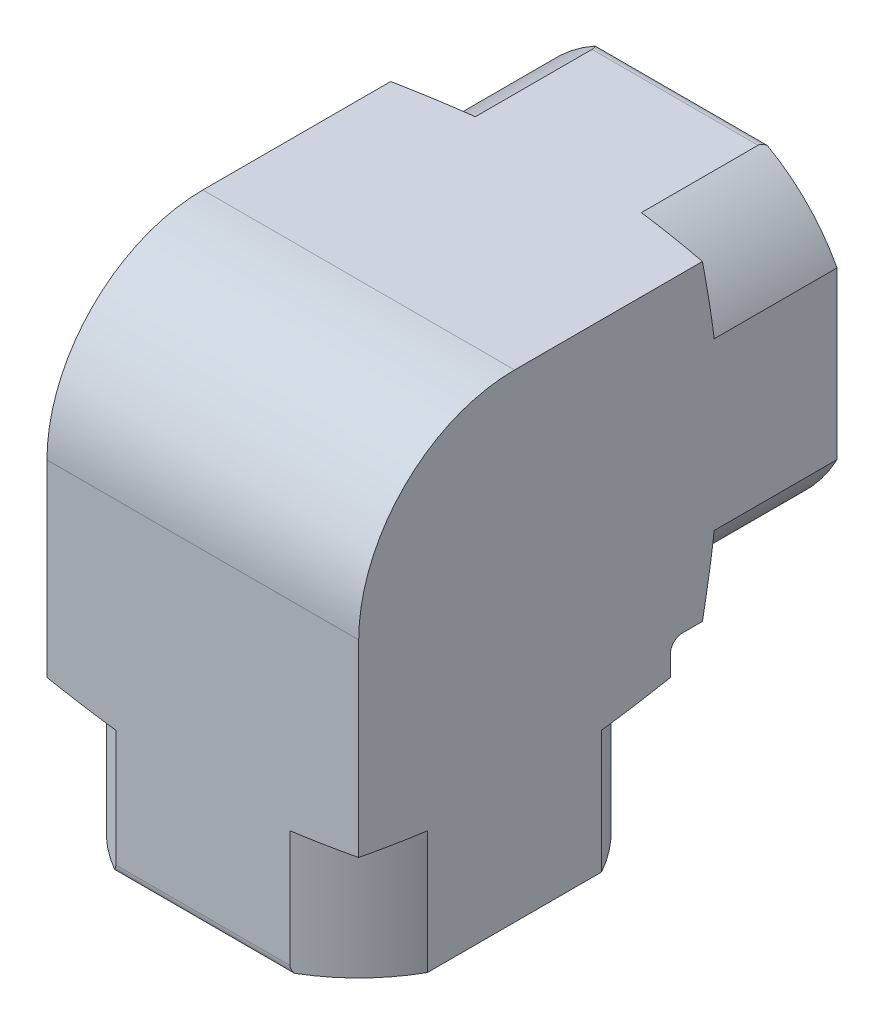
ISO-10303-21;
HEADER;
FILE_DESCRIPTION(('STEP AP214'),'2;1');
FILE_NAME('part.step','',(''),(''),'','','');
FILE_SCHEMA(('AUTOMOTIVE_DESIGN { 1 0 10303 214 1 1 1 1 }'));
ENDSEC;
DATA;
#1=APPLICATION_CONTEXT('core data for automotive mechanical design processes');
#2=APPLICATION_PROTOCOL_DEFINITION('international standard','automotive_design',2000,#1);
#3=PRODUCT_CONTEXT('',#1,'mechanical');
#4=PRODUCT('Part','Part','',(#3));
#5=PRODUCT_RELATED_PRODUCT_CATEGORY('part','',(#4));
#6=PRODUCT_DEFINITION_FORMATION('','',#4);
#7=PRODUCT_DEFINITION_CONTEXT('part definition',#1,'design');
#8=PRODUCT_DEFINITION('design','',#6,#7);
#9=PRODUCT_DEFINITION_SHAPE('','',#8);
#10=(LENGTH_UNIT() NAMED_UNIT(*) SI_UNIT(.MILLI.,.METRE.));
#11=(NAMED_UNIT(*) PLANE_ANGLE_UNIT() SI_UNIT($,.RADIAN.));
#12=(NAMED_UNIT(*) SI_UNIT($,.STERADIAN.) SOLID_ANGLE_UNIT());
#13=UNCERTAINTY_MEASURE_WITH_UNIT(LENGTH_MEASURE(1.E-05),#10,'distance_accuracy_value','');
#14=(GEOMETRIC_REPRESENTATION_CONTEXT(3) GLOBAL_UNCERTAINTY_ASSIGNED_CONTEXT((#13)) GLOBAL_UNIT_ASSIGNED_CONTEXT((#10,
#11,#12)) REPRESENTATION_CONTEXT('',''));
#15=CARTESIAN_POINT('',(0.,0.,0.));
#16=DIRECTION('',(0.,0.,1.));
#17=DIRECTION('',(1.,0.,0.));
#18=AXIS2_PLACEMENT_3D('',#15,#16,#17);
#19=CARTESIAN_POINT('',(0.,-8.70585,0.));
#20=DIRECTION('',(0.,1.,0.));
#21=DIRECTION('',(0.,0.,1.));
#22=AXIS2_PLACEMENT_3D('',#19,#20,#21);
#23=CYLINDRICAL_SURFACE('',#22,7.2517);
#24=CARTESIAN_POINT('',(0.,2.28600000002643,0.));
#25=DIRECTION('',(0.,-1.,0.));
#26=DIRECTION('',(0.,0.,-1.));
#27=AXIS2_PLACEMENT_3D('',#24,#25,#26);
#28=CIRCLE('',#27,7.25169999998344);
#29=CARTESIAN_POINT('',(6.88195879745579,2.28600000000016,2.28600000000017));
#30=VERTEX_POINT('',#29);
#31=CARTESIAN_POINT('',(6.88195879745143,2.28600000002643,-2.28600000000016));
#32=VERTEX_POINT('',#31);
#33=EDGE_CURVE('E234',#30,#32,#28,.F.);
#34=ORIENTED_EDGE('',*,*,#33,.T.);
#35=CARTESIAN_POINT('',(0.,0.,0.));
#36=DIRECTION('',(0.,0.707106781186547,0.707106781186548));
#37=DIRECTION('',(0.,0.707106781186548,-0.707106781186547));
#38=AXIS2_PLACEMENT_3D('',#35,#36,#37);
#39=ELLIPSE('',#38,10.255452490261,7.2517);
#40=CARTESIAN_POINT('',(7.2517,0.,0.));
#41=VERTEX_POINT('',#40);
#42=EDGE_CURVE('E266',#32,#41,#39,.F.);
#43=ORIENTED_EDGE('',*,*,#42,.T.);
#44=CARTESIAN_POINT('',(0.,0.,0.));
#45=DIRECTION('',(0.,0.707106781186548,-0.707106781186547));
#46=DIRECTION('',(0.,0.707106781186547,0.707106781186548));
#47=AXIS2_PLACEMENT_3D('',#44,#45,#46);
#48=ELLIPSE('',#47,10.255452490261,7.2517);
#49=EDGE_CURVE('E268',#41,#30,#48,.F.);
#50=ORIENTED_EDGE('',*,*,#49,.T.);
#51=EDGE_LOOP('',(#34,#43,#50));
#52=FACE_BOUND('',#51,.T.);
#53=ADVANCED_FACE('F24',(#52),#23,.F.);
#54=CARTESIAN_POINT('',(0.,-8.70585,0.));
#55=DIRECTION('',(0.,1.,0.));
#56=DIRECTION('',(0.,0.,1.));
#57=AXIS2_PLACEMENT_3D('',#54,#55,#56);
#58=CYLINDRICAL_SURFACE('',#57,7.2517);
#59=CARTESIAN_POINT('',(0.,2.28600000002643,0.));
#60=DIRECTION('',(0.,-1.,0.));
#61=DIRECTION('',(0.,0.,-1.));
#62=AXIS2_PLACEMENT_3D('',#59,#60,#61);
#63=CIRCLE('',#62,7.25169999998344);
#64=CARTESIAN_POINT('',(-6.88195879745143,2.28600000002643,-2.28600000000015));
#65=VERTEX_POINT('',#64);
#66=CARTESIAN_POINT('',(-6.88195879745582,2.28600000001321,2.28600000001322));
#67=VERTEX_POINT('',#66);
#68=EDGE_CURVE('E242',#65,#67,#63,.F.);
#69=ORIENTED_EDGE('',*,*,#68,.T.);
#70=CARTESIAN_POINT('',(0.,0.,0.));
#71=DIRECTION('',(0.,0.707106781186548,-0.707106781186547));
#72=DIRECTION('',(0.,0.707106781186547,0.707106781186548));
#73=AXIS2_PLACEMENT_3D('',#70,#71,#72);
#74=ELLIPSE('',#73,10.255452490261,7.2517);
#75=CARTESIAN_POINT('',(-7.2517,0.,0.));
#76=VERTEX_POINT('',#75);
#77=EDGE_CURVE('E274',#67,#76,#74,.F.);
#78=ORIENTED_EDGE('',*,*,#77,.T.);
#79=CARTESIAN_POINT('',(0.,0.,0.));
#80=DIRECTION('',(0.,0.707106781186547,0.707106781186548));
#81=DIRECTION('',(0.,0.707106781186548,-0.707106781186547));
#82=AXIS2_PLACEMENT_3D('',#79,#80,#81);
#83=ELLIPSE('',#82,10.255452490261,7.2517);
#84=EDGE_CURVE('E352',#76,#65,#83,.F.);
#85=ORIENTED_EDGE('',*,*,#84,.T.);
#86=EDGE_LOOP('',(#69,#78,#85));
#87=FACE_BOUND('',#86,.T.);
#88=ADVANCED_FACE('F345',(#87),#58,.F.);
#89=CARTESIAN_POINT('',(0.,2.28600000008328,0.));
#90=DIRECTION('',(0.,-1.,0.));
#91=DIRECTION('',(0.,0.,-1.));
#92=AXIS2_PLACEMENT_3D('',#89,#90,#91);
#93=CONICAL_SURFACE('',#92,7.25169999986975,1.08210413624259);
#94=ORIENTED_EDGE('',*,*,#68,.F.);
#95=CARTESIAN_POINT('',(-6.88195879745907,2.28600000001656,-2.28600000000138));
#96=CARTESIAN_POINT('',(-6.87142006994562,2.3177223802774,-2.12850913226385));
#97=CARTESIAN_POINT('',(-6.86149405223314,2.34687352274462,-1.97042605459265));
#98=CARTESIAN_POINT('',(-6.84332676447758,2.39933527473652,-1.65311965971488));
#99=CARTESIAN_POINT('',(-6.83508635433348,2.42264290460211,-1.49389580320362));
#100=CARTESIAN_POINT('',(-6.82076140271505,2.46268549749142,-1.1745152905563));
#101=CARTESIAN_POINT('',(-6.81467682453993,2.47942057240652,-1.01435865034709));
#102=CARTESIAN_POINT('',(-6.80504664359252,2.50573180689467,-0.693405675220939));
#103=CARTESIAN_POINT('',(-6.80150055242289,2.51530934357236,-0.532609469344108));
#104=CARTESIAN_POINT('',(-6.79722767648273,2.52683326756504,-0.213678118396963));
#105=CARTESIAN_POINT('',(-6.79645001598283,2.52891736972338,-0.0555486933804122));
#106=CARTESIAN_POINT('',(-6.79762528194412,2.52575654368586,0.260646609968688));
#107=CARTESIAN_POINT('',(-6.79957856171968,2.52051066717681,0.418712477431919));
#108=CARTESIAN_POINT('',(-6.80608147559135,2.50289719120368,0.734259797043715));
#109=CARTESIAN_POINT('',(-6.81062904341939,2.49053525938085,0.89174161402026));
#110=CARTESIAN_POINT('',(-6.82202879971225,2.45913661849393,1.20595160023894));
#111=CARTESIAN_POINT('',(-6.82888099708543,2.44009988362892,1.36267976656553));
#112=CARTESIAN_POINT('',(-6.83989021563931,2.40897200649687,1.58306193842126));
#113=CARTESIAN_POINT('',(-6.84325515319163,2.39940098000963,1.64712394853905));
#114=CARTESIAN_POINT('',(-6.85027501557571,2.37928535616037,1.77506978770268));
#115=CARTESIAN_POINT('',(-6.85392989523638,2.368740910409,1.83895364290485));
#116=CARTESIAN_POINT('',(-6.86151440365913,2.34668051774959,1.96680056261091));
#117=CARTESIAN_POINT('',(-6.86544507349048,2.33516085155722,2.03076292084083));
#118=CARTESIAN_POINT('',(-6.8735369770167,2.31123385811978,2.15851410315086));
#119=CARTESIAN_POINT('',(-6.87769823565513,2.2988264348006,2.22230290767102));
#120=CARTESIAN_POINT('',(-6.88195879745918,2.28600000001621,2.28600000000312));
#121=B_SPLINE_CURVE_WITH_KNOTS('',3,(#95,#96,#97,#98,#99,#100,#101,#102,#103,#104,#105,#106,
#107,#108,#109,#110,#111,#112,#113,#114,#115,#116,#117,#118,#119,#120),.UNSPECIFIED.,.F.,.F.,(4,
2,2,2,2,2,2,2,2,2,2,2,4),(0.,0.483023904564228,0.966293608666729,1.44955508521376,
1.93272355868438,2.4069655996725,2.88126900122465,3.35519516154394,3.82912315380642,
4.02369866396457,4.21824391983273,4.41356779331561,4.60891283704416),.UNSPECIFIED.);
#122=EDGE_CURVE('E261',#65,#67,#121,.T.);
#123=ORIENTED_EDGE('',*,*,#122,.T.);
#124=EDGE_LOOP('',(#94,#123));
#125=FACE_BOUND('',#124,.T.);
#126=ADVANCED_FACE('F342',(#125),#93,.F.);
#127=CARTESIAN_POINT('',(0.,0.,2.28600000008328));
#128=DIRECTION('',(0.,0.,-1.));
#129=DIRECTION('',(0.,1.,0.));
#130=AXIS2_PLACEMENT_3D('',#127,#128,#129);
#131=CONICAL_SURFACE('',#130,7.25169999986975,1.08210413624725);
#132=CARTESIAN_POINT('',(0.,0.,2.286));
#133=DIRECTION('',(0.,0.,1.));
#134=DIRECTION('',(1.,0.,0.));
#135=AXIS2_PLACEMENT_3D('',#132,#133,#134);
#136=CIRCLE('',#135,7.2517);
#137=EDGE_CURVE('E256',#67,#30,#136,.F.);
#138=ORIENTED_EDGE('',*,*,#137,.T.);
#139=CARTESIAN_POINT('',(6.88195879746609,2.28600000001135,2.28600000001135));
#140=CARTESIAN_POINT('',(6.71868884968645,2.35654784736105,2.35654784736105));
#141=CARTESIAN_POINT('',(6.55459285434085,2.42615354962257,2.42615354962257));
#142=CARTESIAN_POINT('',(6.22452219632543,2.56315205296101,2.56315205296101));
#143=CARTESIAN_POINT('',(6.05854717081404,2.63054441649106,2.63054441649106));
#144=CARTESIAN_POINT('',(5.7239047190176,2.76301741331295,2.76301741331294));
#145=CARTESIAN_POINT('',(5.55522931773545,2.82808800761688,2.82808800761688));
#146=CARTESIAN_POINT('',(5.21562166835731,2.95520476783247,2.95520476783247));
#147=CARTESIAN_POINT('',(5.04468953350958,3.01725108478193,3.01725108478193));
#148=CARTESIAN_POINT('',(4.69559574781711,3.13947993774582,3.13947993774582));
#149=CARTESIAN_POINT('',(4.51736466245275,3.19956403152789,3.19956403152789));
#150=CARTESIAN_POINT('',(4.15808161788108,3.3153510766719,3.3153510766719));
#151=CARTESIAN_POINT('',(3.97702944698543,3.37105369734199,3.37105369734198));
#152=CARTESIAN_POINT('',(3.42984690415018,3.53032031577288,3.53032031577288));
#153=CARTESIAN_POINT('',(3.05908191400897,3.62626163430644,3.62626163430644));
#154=CARTESIAN_POINT('',(2.44021424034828,3.76103385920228,3.76103385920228));
#155=CARTESIAN_POINT('',(2.19566034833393,3.80801866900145,3.80801866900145));
#156=CARTESIAN_POINT('',(1.70205470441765,3.8884404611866,3.8884404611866));
#157=CARTESIAN_POINT('',(1.45300303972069,3.92187770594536,3.92187770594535));
#158=CARTESIAN_POINT('',(0.954590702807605,3.9730539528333,3.9730539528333));
#159=CARTESIAN_POINT('',(0.705267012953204,3.99097027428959,3.99097027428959));
#160=CARTESIAN_POINT('',(0.20534182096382,4.01063391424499,4.01063391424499));
#161=CARTESIAN_POINT('',(-0.0452595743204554,4.01238256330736,4.01238256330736));
#162=CARTESIAN_POINT('',(-0.545876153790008,3.99959074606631,3.99959074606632));
#163=CARTESIAN_POINT('',(-0.795890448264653,3.98503320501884,3.98503320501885));
#164=CARTESIAN_POINT('',(-1.29314762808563,3.94053271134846,3.94053271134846));
#165=CARTESIAN_POINT('',(-1.54039013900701,3.91058770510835,3.91058770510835));
#166=CARTESIAN_POINT('',(-2.03349410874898,3.83657978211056,3.83657978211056));
#167=CARTESIAN_POINT('',(-2.27930773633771,3.79235989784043,3.79235989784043));
#168=CARTESIAN_POINT('',(-2.76594281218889,3.69198651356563,3.69198651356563));
#169=CARTESIAN_POINT('',(-3.00676418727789,3.63583283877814,3.63583283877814));
#170=CARTESIAN_POINT('',(-3.56837608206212,3.49182713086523,3.49182713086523));
#171=CARTESIAN_POINT('',(-3.88702008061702,3.39981579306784,3.39981579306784));
#172=CARTESIAN_POINT('',(-4.51573420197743,3.20195511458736,3.20195511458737));
#173=CARTESIAN_POINT('',(-4.82579774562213,3.09609549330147,3.09609549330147));
#174=CARTESIAN_POINT('',(-5.2812552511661,2.93090947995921,2.93090947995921));
#175=CARTESIAN_POINT('',(-5.4295718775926,2.87555178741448,2.87555178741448));
#176=CARTESIAN_POINT('',(-5.72454661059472,2.76265817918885,2.76265817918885));
#177=CARTESIAN_POINT('',(-5.87120466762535,2.70512219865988,2.70512219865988));
#178=CARTESIAN_POINT('',(-6.16268697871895,2.58827138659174,2.58827138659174));
#179=CARTESIAN_POINT('',(-6.30751442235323,2.52896052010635,2.52896052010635));
#180=CARTESIAN_POINT('',(-6.59575819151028,2.40867454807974,2.40867454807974));
#181=CARTESIAN_POINT('',(-6.73917468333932,2.34769964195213,2.34769964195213));
#182=CARTESIAN_POINT('',(-6.8819587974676,2.2860000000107,2.2860000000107));
#183=B_SPLINE_CURVE_WITH_KNOTS('',3,(#139,#140,#141,#142,#143,#144,#145,#146,#147,#148,#149,
#150,#151,#152,#153,#154,#155,#156,#157,#158,#159,#160,#161,#162,#163,#164,#165,#166,#167,#168,
#169,#170,#171,#172,#173,#174,#175,#176,#177,#178,#179,#180,#181,#182),.UNSPECIFIED.,.F.,.F.,(4,
2,2,2,2,2,2,2,2,2,2,2,2,2,2,2,2,2,2,2,2,4),(0.,0.574029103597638,1.14817101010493,
1.72455170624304,2.30090358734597,2.89313415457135,3.48540937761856,4.66791646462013,
5.42755705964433,6.18718294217,6.9380114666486,7.68877819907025,8.44033181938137,
9.1919857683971,9.95220381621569,10.7124329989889,11.7440893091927,12.7765158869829,
13.2796191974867,13.7827374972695,14.2848052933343,14.7868131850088),.UNSPECIFIED.);
#184=EDGE_CURVE('E27',#30,#67,#183,.T.);
#185=ORIENTED_EDGE('',*,*,#184,.T.);
#186=EDGE_LOOP('',(#138,#185));
#187=FACE_BOUND('',#186,.T.);
#188=ADVANCED_FACE('F257',(#187),#131,.F.);
#189=CARTESIAN_POINT('',(0.,2.28600000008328,0.));
#190=DIRECTION('',(0.,-1.,0.));
#191=DIRECTION('',(0.,0.,-1.));
#192=AXIS2_PLACEMENT_3D('',#189,#190,#191);
#193=CONICAL_SURFACE('',#192,7.25169999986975,1.08210413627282);
#194=ORIENTED_EDGE('',*,*,#33,.F.);
#195=CARTESIAN_POINT('',(6.88195879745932,2.28600000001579,2.28600000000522));
#196=CARTESIAN_POINT('',(6.87142006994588,2.31772238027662,2.12850913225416));
#197=CARTESIAN_POINT('',(6.86149405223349,2.34687352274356,1.97042605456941));
#198=CARTESIAN_POINT('',(6.84332676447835,2.39933527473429,1.65311965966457));
#199=CARTESIAN_POINT('',(6.83508635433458,2.42264290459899,1.49389580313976));
#200=CARTESIAN_POINT('',(6.82076140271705,2.46268549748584,1.17451529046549));
#201=CARTESIAN_POINT('',(6.81467682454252,2.47942057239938,1.01435865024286));
#202=CARTESIAN_POINT('',(6.80504664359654,2.50573180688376,0.693405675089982));
#203=CARTESIAN_POINT('',(6.80150055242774,2.51530934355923,0.532609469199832));
#204=CARTESIAN_POINT('',(6.79722767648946,2.52683326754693,0.213678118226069));
#205=CARTESIAN_POINT('',(6.7964500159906,2.5289173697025,0.0555486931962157));
#206=CARTESIAN_POINT('',(6.79762528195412,2.52575654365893,-0.260646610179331));
#207=CARTESIAN_POINT('',(6.79957856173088,2.5205106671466,-0.418712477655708));
#208=CARTESIAN_POINT('',(6.80608147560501,2.50289719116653,-0.73425979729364));
#209=CARTESIAN_POINT('',(6.81062904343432,2.49053525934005,-0.891741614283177));
#210=CARTESIAN_POINT('',(6.82202879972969,2.45913661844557,-1.2059516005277));
#211=CARTESIAN_POINT('',(6.82888099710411,2.44009988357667,-1.36267976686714));
#212=CARTESIAN_POINT('',(6.83989021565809,2.40897200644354,-1.58306193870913));
#213=CARTESIAN_POINT('',(6.84325515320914,2.39940097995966,-1.64712394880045));
#214=CARTESIAN_POINT('',(6.8502750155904,2.37928535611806,-1.77506978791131));
#215=CARTESIAN_POINT('',(6.85392989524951,2.36874091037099,-1.83895364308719));
#216=CARTESIAN_POINT('',(6.86151440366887,2.34668051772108,-1.96680056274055));
#217=CARTESIAN_POINT('',(6.8654450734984,2.33516085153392,-2.03076292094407));
#218=CARTESIAN_POINT('',(6.87353697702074,2.31123385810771,-2.15851410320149));
#219=CARTESIAN_POINT('',(6.87769823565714,2.29882643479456,-2.22230290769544));
#220=CARTESIAN_POINT('',(6.88195879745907,2.28600000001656,-2.2860000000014));
#221=B_SPLINE_CURVE_WITH_KNOTS('',3,(#195,#196,#197,#198,#199,#200,#201,#202,#203,#204,#205,
#206,#207,#208,#209,#210,#211,#212,#213,#214,#215,#216,#217,#218,#219,#220),.UNSPECIFIED.,.F.,
.F.,(4,2,2,2,2,2,2,2,2,2,2,2,4),(0.,0.483023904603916,0.966293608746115,1.44955508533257,
1.9327235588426,2.40696559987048,2.8812690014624,3.35519516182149,3.82912315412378,
4.02369866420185,4.21824391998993,4.41356779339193,4.60891283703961),.UNSPECIFIED.);
#222=EDGE_CURVE('E238',#30,#32,#221,.T.);
#223=ORIENTED_EDGE('',*,*,#222,.T.);
#224=EDGE_LOOP('',(#194,#223));
#225=FACE_BOUND('',#224,.T.);
#226=ADVANCED_FACE('F236',(#225),#193,.F.);
#227=CARTESIAN_POINT('',(0.,2.28600000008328,0.));
#228=DIRECTION('',(0.,-1.,0.));
#229=DIRECTION('',(0.,0.,-1.));
#230=AXIS2_PLACEMENT_3D('',#227,#228,#229);
#231=CONICAL_SURFACE('',#230,7.25169999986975,1.08210413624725);
#232=CARTESIAN_POINT('',(0.,2.286,0.));
#233=DIRECTION('',(0.,1.,0.));
#234=DIRECTION('',(-1.,0.,0.));
#235=AXIS2_PLACEMENT_3D('',#232,#233,#234);
#236=CIRCLE('',#235,7.2517);
#237=EDGE_CURVE('E250',#30,#67,#236,.F.);
#238=ORIENTED_EDGE('',*,*,#237,.T.);
#239=ORIENTED_EDGE('',*,*,#184,.F.);
#240=EDGE_LOOP('',(#238,#239));
#241=FACE_BOUND('',#240,.T.);
#242=ADVANCED_FACE('F248',(#241),#231,.F.);
#243=CARTESIAN_POINT('',(0.,0.,2.28600000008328));
#244=DIRECTION('',(0.,0.,-1.));
#245=DIRECTION('',(0.,1.,0.));
#246=AXIS2_PLACEMENT_3D('',#243,#244,#245);
#247=CONICAL_SURFACE('',#246,7.25169999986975,1.08210413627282);
#248=CARTESIAN_POINT('',(0.,0.,2.286));
#249=DIRECTION('',(0.,0.,1.));
#250=DIRECTION('',(1.,0.,0.));
#251=AXIS2_PLACEMENT_3D('',#248,#249,#250);
#252=CIRCLE('',#251,7.2517);
#253=CARTESIAN_POINT('',(-6.88195879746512,-2.28600000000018,2.28600000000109));
#254=VERTEX_POINT('',#253);
#255=EDGE_CURVE('E254',#254,#67,#252,.F.);
#256=ORIENTED_EDGE('',*,*,#255,.T.);
#257=CARTESIAN_POINT('',(-6.88195879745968,2.28600000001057,2.28600000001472));
#258=CARTESIAN_POINT('',(-6.87142006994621,2.12850913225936,2.31772238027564));
#259=CARTESIAN_POINT('',(-6.8614940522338,1.97042605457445,2.34687352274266));
#260=CARTESIAN_POINT('',(-6.8433267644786,1.65311965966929,2.39933527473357));
#261=CARTESIAN_POINT('',(-6.8350863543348,1.49389580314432,2.42264290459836));
#262=CARTESIAN_POINT('',(-6.82076140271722,1.17451529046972,2.46268549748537));
#263=CARTESIAN_POINT('',(-6.81467682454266,1.01435865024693,2.47942057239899));
#264=CARTESIAN_POINT('',(-6.80504664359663,0.693405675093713,2.50573180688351));
#265=CARTESIAN_POINT('',(-6.80150055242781,0.532609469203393,2.51530934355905));
#266=CARTESIAN_POINT('',(-6.79722767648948,0.213678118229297,2.52683326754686));
#267=CARTESIAN_POINT('',(-6.7964500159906,0.0555486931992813,2.52891736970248));
#268=CARTESIAN_POINT('',(-6.7976252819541,-0.260646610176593,2.525756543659));
#269=CARTESIAN_POINT('',(-6.79957856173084,-0.418712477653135,2.52051066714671));
#270=CARTESIAN_POINT('',(-6.80608147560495,-0.734259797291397,2.50289719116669));
#271=CARTESIAN_POINT('',(-6.81062904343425,-0.891741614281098,2.49053525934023));
#272=CARTESIAN_POINT('',(-6.82202879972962,-1.20595160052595,2.45913661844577));
#273=CARTESIAN_POINT('',(-6.82888099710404,-1.36267976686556,2.44009988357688));
#274=CARTESIAN_POINT('',(-6.83989021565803,-1.58306193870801,2.40897200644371));
#275=CARTESIAN_POINT('',(-6.84325515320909,-1.64712394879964,2.39940097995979));
#276=CARTESIAN_POINT('',(-6.85027501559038,-1.77506978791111,2.3792853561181));
#277=CARTESIAN_POINT('',(-6.85392989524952,-1.83895364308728,2.36874091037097));
#278=CARTESIAN_POINT('',(-6.86151440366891,-1.96680056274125,2.34668051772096));
#279=CARTESIAN_POINT('',(-6.86544507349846,-2.03076292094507,2.33516085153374));
#280=CARTESIAN_POINT('',(-6.87353697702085,-2.15851410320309,2.31123385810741));
#281=CARTESIAN_POINT('',(-6.87769823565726,-2.22230290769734,2.29882643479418));
#282=CARTESIAN_POINT('',(-6.88195879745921,-2.2860000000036,2.28600000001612));
#283=B_SPLINE_CURVE_WITH_KNOTS('',3,(#257,#258,#259,#260,#261,#262,#263,#264,#265,#266,#267,
#268,#269,#270,#271,#272,#273,#274,#275,#276,#277,#278,#279,#280,#281,#282),.UNSPECIFIED.,.F.,
.F.,(4,2,2,2,2,2,2,2,2,2,2,2,4),(0.,0.483023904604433,0.966293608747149,1.44955508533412,
1.93272355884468,2.40696559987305,2.88126900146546,3.35519516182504,3.82912315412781,
4.0236986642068,4.2182439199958,4.41356779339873,4.60891283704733),.UNSPECIFIED.);
#284=EDGE_CURVE('E283',#67,#254,#283,.T.);
#285=ORIENTED_EDGE('',*,*,#284,.T.);
#286=EDGE_LOOP('',(#256,#285));
#287=FACE_BOUND('',#286,.T.);
#288=ADVANCED_FACE('F329',(#287),#247,.F.);
#289=CARTESIAN_POINT('',(0.,0.,-15.43685));
#290=DIRECTION('',(0.,0.,1.));
#291=DIRECTION('',(1.,0.,0.));
#292=AXIS2_PLACEMENT_3D('',#289,#290,#291);
#293=CYLINDRICAL_SURFACE('',#292,7.2517);
#294=ORIENTED_EDGE('',*,*,#77,.F.);
#295=ORIENTED_EDGE('',*,*,#255,.F.);
#296=CARTESIAN_POINT('',(0.,0.,0.));
#297=DIRECTION('',(0.,0.707106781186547,0.707106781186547));
#298=DIRECTION('',(0.,-0.707106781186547,0.707106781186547));
#299=AXIS2_PLACEMENT_3D('',#296,#297,#298);
#300=ELLIPSE('',#299,10.255452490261,7.2517);
#301=EDGE_CURVE('E323',#254,#76,#300,.F.);
#302=ORIENTED_EDGE('',*,*,#301,.T.);
#303=EDGE_LOOP('',(#294,#295,#302));
#304=FACE_BOUND('',#303,.T.);
#305=ADVANCED_FACE('F333',(#304),#293,.F.);
#306=CARTESIAN_POINT('',(0.,0.,-15.43685));
#307=DIRECTION('',(0.,0.,1.));
#308=DIRECTION('',(1.,0.,0.));
#309=AXIS2_PLACEMENT_3D('',#306,#307,#308);
#310=CYLINDRICAL_SURFACE('',#309,7.2517);
#311=CARTESIAN_POINT('',(0.,0.,2.28600000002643));
#312=DIRECTION('',(0.,0.,-1.));
#313=DIRECTION('',(0.,-1.,0.));
#314=AXIS2_PLACEMENT_3D('',#311,#312,#313);
#315=CIRCLE('',#314,7.25169999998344);
#316=CARTESIAN_POINT('',(6.88195879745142,-2.28600000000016,2.28600000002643));
#317=VERTEX_POINT('',#316);
#318=EDGE_CURVE('E273',#317,#30,#315,.F.);
#319=ORIENTED_EDGE('',*,*,#318,.T.);
#320=ORIENTED_EDGE('',*,*,#49,.F.);
#321=CARTESIAN_POINT('',(0.,0.,0.));
#322=DIRECTION('',(0.,0.707106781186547,0.707106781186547));
#323=DIRECTION('',(0.,-0.707106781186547,0.707106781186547));
#324=AXIS2_PLACEMENT_3D('',#321,#322,#323);
#325=ELLIPSE('',#324,10.255452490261,7.2517);
#326=EDGE_CURVE('E286',#41,#317,#325,.F.);
#327=ORIENTED_EDGE('',*,*,#326,.T.);
#328=EDGE_LOOP('',(#319,#320,#327));
#329=FACE_BOUND('',#328,.T.);
#330=ADVANCED_FACE('F285',(#329),#310,.F.);
#331=CARTESIAN_POINT('',(0.,0.,2.28600000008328));
#332=DIRECTION('',(0.,0.,-1.));
#333=DIRECTION('',(0.,1.,0.));
#334=AXIS2_PLACEMENT_3D('',#331,#332,#333);
#335=CONICAL_SURFACE('',#334,7.25169999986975,1.08210413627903);
#336=ORIENTED_EDGE('',*,*,#318,.F.);
#337=CARTESIAN_POINT('',(6.88195879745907,-2.28600000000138,2.28600000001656));
#338=CARTESIAN_POINT('',(6.87142006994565,-2.12850913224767,2.31772238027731));
#339=CARTESIAN_POINT('',(6.8614940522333,-1.97042605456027,2.34687352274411));
#340=CARTESIAN_POINT('',(6.8433267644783,-1.65311965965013,2.39933527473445));
#341=CARTESIAN_POINT('',(6.83508635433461,-1.49389580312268,2.42264290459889));
#342=CARTESIAN_POINT('',(6.82076140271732,-1.17451529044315,2.4626854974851));
#343=CARTESIAN_POINT('',(6.81467682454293,-1.01435865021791,2.47942057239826));
#344=CARTESIAN_POINT('',(6.80504664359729,-0.693405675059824,2.50573180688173));
#345=CARTESIAN_POINT('',(6.80150055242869,-0.532609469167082,2.51530934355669));
#346=CARTESIAN_POINT('',(6.79722767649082,-0.213678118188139,2.52683326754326));
#347=CARTESIAN_POINT('',(6.79645001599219,-0.0555486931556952,2.52891736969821));
#348=CARTESIAN_POINT('',(6.79762528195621,0.260646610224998,2.52575654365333));
#349=CARTESIAN_POINT('',(6.79957856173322,0.41871247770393,2.5205106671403));
#350=CARTESIAN_POINT('',(6.80608147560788,0.734259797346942,2.50289719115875));
#351=CARTESIAN_POINT('',(6.81062904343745,0.891741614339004,2.4905352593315));
#352=CARTESIAN_POINT('',(6.82202879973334,1.20595160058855,2.45913661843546));
#353=CARTESIAN_POINT('',(6.82888099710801,1.36267976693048,2.44009988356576));
#354=CARTESIAN_POINT('',(6.83989021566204,1.58306193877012,2.40897200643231));
#355=CARTESIAN_POINT('',(6.84325515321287,1.64712394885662,2.39940097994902));
#356=CARTESIAN_POINT('',(6.85027501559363,1.77506978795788,2.37928535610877));
#357=CARTESIAN_POINT('',(6.85392989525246,1.83895364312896,2.36874091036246));
#358=CARTESIAN_POINT('',(6.86151440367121,1.96680056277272,2.34668051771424));
#359=CARTESIAN_POINT('',(6.86544507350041,2.03076292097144,2.33516085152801));
#360=CARTESIAN_POINT('',(6.87353697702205,2.15851410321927,2.31123385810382));
#361=CARTESIAN_POINT('',(6.87769823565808,2.22230290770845,2.29882643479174));
#362=CARTESIAN_POINT('',(6.88195879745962,2.28600000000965,2.2860000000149));
#363=B_SPLINE_CURVE_WITH_KNOTS('',3,(#337,#338,#339,#340,#341,#342,#343,#344,#345,#346,#347,
#348,#349,#350,#351,#352,#353,#354,#355,#356,#357,#358,#359,#360,#361,#362),.UNSPECIFIED.,.F.,
.F.,(4,2,2,2,2,2,2,2,2,2,2,2,4),(0.,0.483023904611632,0.966293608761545,1.44955508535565,
1.93272355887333,2.40696559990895,2.88126900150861,3.35519516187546,3.82912315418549,
4.02369866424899,4.21824392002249,4.41356779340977,4.60891283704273),.UNSPECIFIED.);
#364=EDGE_CURVE('E280',#317,#30,#363,.T.);
#365=ORIENTED_EDGE('',*,*,#364,.T.);
#366=EDGE_LOOP('',(#336,#365));
#367=FACE_BOUND('',#366,.T.);
#368=ADVANCED_FACE('F289',(#367),#335,.F.);
#369=CARTESIAN_POINT('',(0.,0.,-15.43685));
#370=DIRECTION('',(0.,0.,1.));
#371=DIRECTION('',(1.,0.,0.));
#372=AXIS2_PLACEMENT_3D('',#369,#370,#371);
#373=CYLINDRICAL_SURFACE('',#372,7.2517);
#374=ORIENTED_EDGE('',*,*,#137,.F.);
#375=ORIENTED_EDGE('',*,*,#122,.F.);
#376=ORIENTED_EDGE('',*,*,#84,.F.);
#377=CARTESIAN_POINT('',(0.,0.,0.));
#378=DIRECTION('',(0.,-0.707106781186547,0.707106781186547));
#379=DIRECTION('',(0.,0.707106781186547,0.707106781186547));
#380=AXIS2_PLACEMENT_3D('',#377,#378,#379);
#381=ELLIPSE('',#380,10.255452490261,7.2517);
#382=EDGE_CURVE('E295',#76,#41,#381,.T.);
#383=ORIENTED_EDGE('',*,*,#382,.T.);
#384=ORIENTED_EDGE('',*,*,#42,.F.);
#385=ORIENTED_EDGE('',*,*,#222,.F.);
#386=EDGE_LOOP('',(#374,#375,#376,#383,#384,#385));
#387=FACE_BOUND('',#386,.T.);
#388=CARTESIAN_POINT('',(0.,0.,-15.7056874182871));
#389=DIRECTION('',(0.,0.,-1.));
#390=DIRECTION('',(0.,-1.,0.));
#391=AXIS2_PLACEMENT_3D('',#388,#389,#390);
#392=CIRCLE('',#391,7.25169999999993);
#393=CARTESIAN_POINT('',(0.,-7.25169999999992,-15.7056874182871));
#394=VERTEX_POINT('',#393);
#395=EDGE_CURVE('E290',#394,#394,#392,.T.);
#396=ORIENTED_EDGE('',*,*,#395,.T.);
#397=EDGE_LOOP('',(#396));
#398=FACE_BOUND('',#397,.T.);
#399=ADVANCED_FACE('F263',(#387,#398),#373,.F.);
#400=CARTESIAN_POINT('',(0.,-15.43685,0.));
#401=DIRECTION('',(0.,1.,0.));
#402=DIRECTION('',(-1.,0.,0.));
#403=AXIS2_PLACEMENT_3D('',#400,#401,#402);
#404=CYLINDRICAL_SURFACE('',#403,7.2517);
#405=CARTESIAN_POINT('',(0.,-15.7056874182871,0.));
#406=DIRECTION('',(0.,-1.,0.));
#407=DIRECTION('',(0.,0.,-1.));
#408=AXIS2_PLACEMENT_3D('',#405,#406,#407);
#409=CIRCLE('',#408,7.25169999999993);
#410=CARTESIAN_POINT('',(0.,-15.7056874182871,-7.25169999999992));
#411=VERTEX_POINT('',#410);
#412=EDGE_CURVE('E293',#411,#411,#409,.T.);
#413=ORIENTED_EDGE('',*,*,#412,.T.);
#414=EDGE_LOOP('',(#413));
#415=FACE_BOUND('',#414,.T.);
#416=ORIENTED_EDGE('',*,*,#326,.F.);
#417=ORIENTED_EDGE('',*,*,#382,.F.);
#418=ORIENTED_EDGE('',*,*,#301,.F.);
#419=ORIENTED_EDGE('',*,*,#284,.F.);
#420=ORIENTED_EDGE('',*,*,#237,.F.);
#421=ORIENTED_EDGE('',*,*,#364,.F.);
#422=EDGE_LOOP('',(#416,#417,#418,#419,#420,#421));
#423=FACE_BOUND('',#422,.T.);
#424=ADVANCED_FACE('F278',(#415,#423),#404,.F.);
#425=CARTESIAN_POINT('',(0.,0.,-19.8322622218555));
#426=DIRECTION('',(0.,0.,-1.));
#427=DIRECTION('',(0.,1.,0.));
#428=AXIS2_PLACEMENT_3D('',#425,#426,#427);
#429=CONICAL_SURFACE('',#428,7.38626222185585,0.0325971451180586);
#430=ORIENTED_EDGE('',*,*,#395,.F.);
#431=EDGE_LOOP('',(#430));
#432=FACE_BOUND('',#431,.T.);
#433=CARTESIAN_POINT('',(0.,0.,-19.8322622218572));
#434=DIRECTION('',(0.,0.,-1.));
#435=DIRECTION('',(0.,-1.,0.));
#436=AXIS2_PLACEMENT_3D('',#433,#434,#435);
#437=CIRCLE('',#436,7.38626222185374);
#438=CARTESIAN_POINT('',(0.,-7.38626222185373,-19.8322622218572));
#439=VERTEX_POINT('',#438);
#440=EDGE_CURVE('E664',#439,#439,#437,.T.);
#441=ORIENTED_EDGE('',*,*,#440,.T.);
#442=EDGE_LOOP('',(#441));
#443=FACE_BOUND('',#442,.T.);
#444=ADVANCED_FACE('F312',(#432,#443),#429,.F.);
#445=CARTESIAN_POINT('',(0.,0.,-12.4263022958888));
#446=DIRECTION('',(0.,0.,1.));
#447=DIRECTION('',(1.,0.,0.));
#448=AXIS2_PLACEMENT_3D('',#445,#446,#447);
#449=CONICAL_SURFACE('',#448,14.6013355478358,1.308996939);
#450=CARTESIAN_POINT('',(0.,0.,-13.208));
#451=DIRECTION('',(0.,0.,1.));
#452=DIRECTION('',(1.,0.,0.));
#453=AXIS2_PLACEMENT_3D('',#450,#451,#452);
#454=CIRCLE('',#453,11.684);
#455=CARTESIAN_POINT('',(10.3124,-5.4927463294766,-13.2079999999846));
#456=VERTEX_POINT('',#455);
#457=CARTESIAN_POINT('',(5.4927463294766,-10.3124,-13.2079999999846));
#458=VERTEX_POINT('',#457);
#459=EDGE_CURVE('E672',#456,#458,#454,.F.);
#460=ORIENTED_EDGE('',*,*,#459,.F.);
#461=CARTESIAN_POINT('',(10.3124,-5.49274632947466,-13.2079999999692));
#462=CARTESIAN_POINT('',(10.3124,-5.89652004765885,-13.1571182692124));
#463=CARTESIAN_POINT('',(10.3124,-6.2997325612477,-13.1019774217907));
#464=CARTESIAN_POINT('',(10.3124,-7.10499898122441,-12.9844036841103));
#465=CARTESIAN_POINT('',(10.3124,-7.50705313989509,-12.9219725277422));
#466=CARTESIAN_POINT('',(10.3124,-8.31012887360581,-12.7910238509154));
#467=CARTESIAN_POINT('',(10.3124,-8.71115052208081,-12.7225067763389));
#468=CARTESIAN_POINT('',(10.3124,-9.51238304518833,-12.5803394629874));
#469=CARTESIAN_POINT('',(10.3124,-9.91259370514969,-12.5066880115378));
#470=CARTESIAN_POINT('',(10.3124,-10.3123999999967,-12.4309645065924));
#471=B_SPLINE_CURVE_WITH_KNOTS('',3,(#461,#462,#463,#464,#465,#466,#467,#468,#469,#470),
.UNSPECIFIED.,.F.,.F.,(4,2,2,2,4),(0.,1.22084366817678,2.44139756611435,3.66186211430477,
4.88261590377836),.UNSPECIFIED.);
#472=CARTESIAN_POINT('',(10.3123999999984,-10.3124,-12.4309645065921));
#473=VERTEX_POINT('',#472);
#474=EDGE_CURVE('E472',#456,#473,#471,.T.);
#475=ORIENTED_EDGE('',*,*,#474,.T.);
#476=CARTESIAN_POINT('',(5.4927463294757,-10.3124000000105,-13.2079999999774));
#477=CARTESIAN_POINT('',(5.89652004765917,-10.3124000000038,-13.1571182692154));
#478=CARTESIAN_POINT('',(6.29973256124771,-10.312400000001,-13.1019774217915));
#479=CARTESIAN_POINT('',(7.10499898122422,-10.312399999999,-12.9844036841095));
#480=CARTESIAN_POINT('',(7.507053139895,-10.3123999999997,-12.921972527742));
#481=CARTESIAN_POINT('',(8.31012887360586,-10.3124000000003,-12.7910238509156));
#482=CARTESIAN_POINT('',(8.7111505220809,-10.3124000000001,-12.722506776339));
#483=CARTESIAN_POINT('',(9.51238304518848,-10.3123999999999,-12.5803394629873));
#484=CARTESIAN_POINT('',(9.91259370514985,-10.3123999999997,-12.5066880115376));
#485=CARTESIAN_POINT('',(10.3123999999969,-10.3124,-12.4309645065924));
#486=B_SPLINE_CURVE_WITH_KNOTS('',3,(#476,#477,#478,#479,#480,#481,#482,#483,#484,#485),
.UNSPECIFIED.,.F.,.F.,(4,2,2,2,4),(0.,1.22084366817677,2.4413975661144,3.66186211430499,
4.88261590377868),.UNSPECIFIED.);
#487=EDGE_CURVE('E687',#458,#473,#486,.T.);
#488=ORIENTED_EDGE('',*,*,#487,.F.);
#489=EDGE_LOOP('',(#460,#475,#488));
#490=FACE_BOUND('',#489,.T.);
#491=ADVANCED_FACE('F1055',(#490),#449,.T.);
#492=CARTESIAN_POINT('',(0.,-19.8322622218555,0.));
#493=DIRECTION('',(0.,-1.,0.));
#494=DIRECTION('',(0.,0.,-1.));
#495=AXIS2_PLACEMENT_3D('',#492,#493,#494);
#496=CONICAL_SURFACE('',#495,7.38626222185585,0.0325971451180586);
#497=ORIENTED_EDGE('',*,*,#412,.F.);
#498=EDGE_LOOP('',(#497));
#499=FACE_BOUND('',#498,.T.);
#500=CARTESIAN_POINT('',(0.,-19.8322622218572,0.));
#501=DIRECTION('',(0.,-1.,0.));
#502=DIRECTION('',(0.,0.,-1.));
#503=AXIS2_PLACEMENT_3D('',#500,#501,#502);
#504=CIRCLE('',#503,7.38626222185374);
#505=CARTESIAN_POINT('',(0.,-19.8322622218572,-7.38626222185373));
#506=VERTEX_POINT('',#505);
#507=EDGE_CURVE('E637',#506,#506,#504,.T.);
#508=ORIENTED_EDGE('',*,*,#507,.T.);
#509=EDGE_LOOP('',(#508));
#510=FACE_BOUND('',#509,.T.);
#511=ADVANCED_FACE('F1047',(#499,#510),#496,.F.);
#512=CARTESIAN_POINT('',(0.,-11.0998,-11.0998));
#513=DIRECTION('',(1.,0.,0.));
#514=DIRECTION('',(0.,0.,-1.));
#515=AXIS2_PLACEMENT_3D('',#512,#513,#514);
#516=CYLINDRICAL_SURFACE('',#515,0.787399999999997);
#517=DIRECTION('',(-1.,0.,0.));
#518=VECTOR('',#517,1.);
#519=CARTESIAN_POINT('',(0.,-11.0998,-10.3124));
#520=LINE('',#519,#518);
#521=CARTESIAN_POINT('',(-10.3124,-11.0998,-10.3124));
#522=VERTEX_POINT('',#521);
#523=CARTESIAN_POINT('',(10.3124,-11.0998,-10.3124));
#524=VERTEX_POINT('',#523);
#525=EDGE_CURVE('E634',#522,#524,#520,.F.);
#526=ORIENTED_EDGE('',*,*,#525,.F.);
#527=CARTESIAN_POINT('',(-10.3124,-11.0998,-11.0998));
#528=DIRECTION('',(1.,0.,0.));
#529=DIRECTION('',(0.,0.,-1.));
#530=AXIS2_PLACEMENT_3D('',#527,#528,#529);
#531=CIRCLE('',#530,0.787399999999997);
#532=CARTESIAN_POINT('',(-10.3124,-10.3124,-11.0998));
#533=VERTEX_POINT('',#532);
#534=EDGE_CURVE('E303',#533,#522,#531,.T.);
#535=ORIENTED_EDGE('',*,*,#534,.F.);
#536=DIRECTION('',(1.,0.,0.));
#537=VECTOR('',#536,1.);
#538=CARTESIAN_POINT('',(0.,-10.3124,-11.0998));
#539=LINE('',#538,#537);
#540=CARTESIAN_POINT('',(10.3124,-10.3124,-11.0998));
#541=VERTEX_POINT('',#540);
#542=EDGE_CURVE('E678',#541,#533,#539,.F.);
#543=ORIENTED_EDGE('',*,*,#542,.F.);
#544=CARTESIAN_POINT('',(10.3124,-11.0998,-11.0998));
#545=DIRECTION('',(1.,0.,0.));
#546=DIRECTION('',(0.,0.,-1.));
#547=AXIS2_PLACEMENT_3D('',#544,#545,#546);
#548=CIRCLE('',#547,0.787399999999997);
#549=EDGE_CURVE('E452',#541,#524,#548,.T.);
#550=ORIENTED_EDGE('',*,*,#549,.T.);
#551=EDGE_LOOP('',(#526,#535,#543,#550));
#552=FACE_BOUND('',#551,.T.);
#553=ADVANCED_FACE('F437',(#552),#516,.F.);
#554=CARTESIAN_POINT('',(0.,-12.4605360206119,0.));
#555=DIRECTION('',(0.,1.,0.));
#556=DIRECTION('',(-1.,0.,0.));
#557=AXIS2_PLACEMENT_3D('',#554,#555,#556);
#558=CONICAL_SURFACE('',#557,14.6005735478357,1.308996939);
#559=CARTESIAN_POINT('',(10.3124,-12.4649940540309,-10.3123999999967));
#560=CARTESIAN_POINT('',(10.3124,-12.5365742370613,-9.93449163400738));
#561=CARTESIAN_POINT('',(10.3124,-12.6062977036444,-9.55622222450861));
#562=CARTESIAN_POINT('',(10.3124,-12.7412042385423,-8.79895561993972));
#563=CARTESIAN_POINT('',(10.3124,-12.8063882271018,-8.41995858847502));
#564=CARTESIAN_POINT('',(10.3124,-12.9314223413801,-7.66105478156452));
#565=CARTESIAN_POINT('',(10.3124,-12.9912721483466,-7.28114795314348));
#566=CARTESIAN_POINT('',(10.3124,-13.1046405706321,-6.52031453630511));
#567=CARTESIAN_POINT('',(10.3124,-13.158157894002,-6.13938775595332));
#568=CARTESIAN_POINT('',(10.3124,-13.2079999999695,-5.7579620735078));
#569=B_SPLINE_CURVE_WITH_KNOTS('',3,(#559,#560,#561,#562,#563,#564,#565,#566,#567,#568),
.UNSPECIFIED.,.F.,.F.,(4,2,2,2,4),(0.,1.15389161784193,2.30754863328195,3.46127454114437,
4.61523542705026),.UNSPECIFIED.);
#570=CARTESIAN_POINT('',(10.3124,-12.4649940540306,-10.3123999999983));
#571=VERTEX_POINT('',#570);
#572=CARTESIAN_POINT('',(10.3124,-13.2079999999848,-5.75796207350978));
#573=VERTEX_POINT('',#572);
#574=EDGE_CURVE('E444',#571,#573,#569,.T.);
#575=ORIENTED_EDGE('',*,*,#574,.T.);
#576=CARTESIAN_POINT('',(0.,-13.208,0.));
#577=DIRECTION('',(0.,-1.,0.));
#578=DIRECTION('',(0.,0.,-1.));
#579=AXIS2_PLACEMENT_3D('',#576,#577,#578);
#580=CIRCLE('',#579,11.811);
#581=CARTESIAN_POINT('',(5.75796207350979,-13.2079999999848,-10.3124));
#582=VERTEX_POINT('',#581);
#583=EDGE_CURVE('E451',#582,#573,#580,.T.);
#584=ORIENTED_EDGE('',*,*,#583,.F.);
#585=CARTESIAN_POINT('',(10.3123999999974,-12.4649940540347,-10.3124000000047));
#586=CARTESIAN_POINT('',(9.93449163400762,-12.5365742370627,-10.3124000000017));
#587=CARTESIAN_POINT('',(9.55622222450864,-12.6062977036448,-10.3124000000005));
#588=CARTESIAN_POINT('',(8.79895561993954,-12.7412042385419,-10.3123999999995));
#589=CARTESIAN_POINT('',(8.41995858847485,-12.8063882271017,-10.3123999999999));
#590=CARTESIAN_POINT('',(7.66105478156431,-12.9314223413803,-10.3124000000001));
#591=CARTESIAN_POINT('',(7.28114795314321,-12.9912721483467,-10.3124000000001));
#592=CARTESIAN_POINT('',(6.52031453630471,-13.1046405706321,-10.3123999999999));
#593=CARTESIAN_POINT('',(6.13938775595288,-13.1581578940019,-10.3123999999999));
#594=CARTESIAN_POINT('',(5.75796207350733,-13.2079999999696,-10.3124));
#595=B_SPLINE_CURVE_WITH_KNOTS('',3,(#585,#586,#587,#588,#589,#590,#591,#592,#593,#594),
.UNSPECIFIED.,.F.,.F.,(4,2,2,2,4),(0.,1.15389161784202,2.30754863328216,3.46127454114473,
4.61523542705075),.UNSPECIFIED.);
#596=EDGE_CURVE('E411',#571,#582,#595,.T.);
#597=ORIENTED_EDGE('',*,*,#596,.F.);
#598=EDGE_LOOP('',(#575,#584,#597));
#599=FACE_BOUND('',#598,.T.);
#600=ADVANCED_FACE('F432',(#599),#558,.T.);
#601=CARTESIAN_POINT('',(0.,-10.3124,-20.9296));
#602=DIRECTION('',(0.,-1.,0.));
#603=DIRECTION('',(0.,0.,-1.));
#604=AXIS2_PLACEMENT_3D('',#601,#602,#603);
#605=PLANE('',#604);
#606=DIRECTION('',(0.,0.,1.));
#607=VECTOR('',#606,1.);
#608=CARTESIAN_POINT('',(-5.49274632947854,-10.3124,-17.272));
#609=LINE('',#608,#607);
#610=CARTESIAN_POINT('',(-5.49274632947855,-10.3124,-20.9296));
#611=VERTEX_POINT('',#610);
#612=CARTESIAN_POINT('',(-5.49274632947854,-10.3124,-13.2079999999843));
#613=VERTEX_POINT('',#612);
#614=EDGE_CURVE('E626',#611,#613,#609,.T.);
#615=ORIENTED_EDGE('',*,*,#614,.F.);
#616=DIRECTION('',(1.,0.,0.));
#617=VECTOR('',#616,1.);
#618=CARTESIAN_POINT('',(0.,-10.3124,-20.9296));
#619=LINE('',#618,#617);
#620=CARTESIAN_POINT('',(5.49274632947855,-10.3124,-20.9296));
#621=VERTEX_POINT('',#620);
#622=EDGE_CURVE('E673',#621,#611,#619,.F.);
#623=ORIENTED_EDGE('',*,*,#622,.F.);
#624=DIRECTION('',(0.,0.,1.));
#625=VECTOR('',#624,1.);
#626=CARTESIAN_POINT('',(5.49274632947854,-10.3124,-17.272));
#627=LINE('',#626,#625);
#628=EDGE_CURVE('E667',#458,#621,#627,.F.);
#629=ORIENTED_EDGE('',*,*,#628,.F.);
#630=ORIENTED_EDGE('',*,*,#487,.T.);
#631=DIRECTION('',(0.,0.,1.));
#632=VECTOR('',#631,1.);
#633=CARTESIAN_POINT('',(10.3124,-10.3124,0.));
#634=LINE('',#633,#632);
#635=EDGE_CURVE('E646',#473,#541,#634,.T.);
#636=ORIENTED_EDGE('',*,*,#635,.T.);
#637=ORIENTED_EDGE('',*,*,#542,.T.);
#638=DIRECTION('',(0.,0.,-1.));
#639=VECTOR('',#638,1.);
#640=CARTESIAN_POINT('',(-10.3124,-10.3124,-20.9296));
#641=LINE('',#640,#639);
#642=CARTESIAN_POINT('',(-10.312399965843,-10.3124,-12.4309645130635));
#643=VERTEX_POINT('',#642);
#644=EDGE_CURVE('E676',#533,#643,#641,.T.);
#645=ORIENTED_EDGE('',*,*,#644,.T.);
#646=CARTESIAN_POINT('',(-5.49274632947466,-10.3124,-13.2079999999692));
#647=CARTESIAN_POINT('',(-5.8965200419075,-10.3124,-13.1571182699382));
#648=CARTESIAN_POINT('',(-6.29973254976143,-10.3124,-13.1019774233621));
#649=CARTESIAN_POINT('',(-7.10499895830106,-10.3124,-12.9844036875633));
#650=CARTESIAN_POINT('',(-7.50705311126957,-10.3124,-12.921972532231));
#651=CARTESIAN_POINT('',(-8.31012883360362,-10.3124,-12.791023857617));
#652=CARTESIAN_POINT('',(-8.71115047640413,-10.3124,-12.7225067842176));
#653=CARTESIAN_POINT('',(-9.51238298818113,-10.3124,-12.5803394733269));
#654=CARTESIAN_POINT('',(-9.91259364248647,-10.3124,-12.5066880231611));
#655=CARTESIAN_POINT('',(-10.312399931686,-10.3124,-12.4309645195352));
#656=B_SPLINE_CURVE_WITH_KNOTS('',3,(#646,#647,#648,#649,#650,#651,#652,#653,#654,#655),
.UNSPECIFIED.,.F.,.F.,(4,2,2,2,4),(0.,1.22084365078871,2.44139753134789,3.66186206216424,
4.88261583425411),.UNSPECIFIED.);
#657=EDGE_CURVE('E420',#613,#643,#656,.T.);
#658=ORIENTED_EDGE('',*,*,#657,.F.);
#659=EDGE_LOOP('',(#615,#623,#629,#630,#636,#637,#645,#658));
#660=FACE_BOUND('',#659,.T.);
#661=ADVANCED_FACE('F436',(#660),#605,.T.);
#662=CARTESIAN_POINT('',(0.,-9.525,-20.9296));
#663=DIRECTION('',(1.,0.,0.));
#664=DIRECTION('',(0.,0.,-1.));
#665=AXIS2_PLACEMENT_3D('',#662,#663,#664);
#666=CYLINDRICAL_SURFACE('',#665,0.787399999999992);
#667=CARTESIAN_POINT('',(-5.69980317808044,-10.1994166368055,-21.336));
#668=CARTESIAN_POINT('',(-5.677452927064,-10.2119114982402,-21.3152151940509));
#669=CARTESIAN_POINT('',(-5.65578394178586,-10.223919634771,-21.2931595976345));
#670=CARTESIAN_POINT('',(-5.61451544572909,-10.2466391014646,-21.2457525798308));
#671=CARTESIAN_POINT('',(-5.5949640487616,-10.2573208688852,-21.2203456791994));
#672=CARTESIAN_POINT('',(-5.56301688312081,-10.274676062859,-21.1715013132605));
#673=CARTESIAN_POINT('',(-5.54996866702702,-10.2817251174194,-21.1486362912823));
#674=CARTESIAN_POINT('',(-5.52734190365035,-10.2939064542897,-21.1010037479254));
#675=CARTESIAN_POINT('',(-5.51773071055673,-10.2990567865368,-21.0762569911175));
#676=CARTESIAN_POINT('',(-5.50465966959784,-10.3060478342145,-21.0313091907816));
#677=CARTESIAN_POINT('',(-5.50027377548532,-10.30838801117,-21.0114587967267));
#678=CARTESIAN_POINT('',(-5.494278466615,-10.3115839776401,-20.9709616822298));
#679=CARTESIAN_POINT('',(-5.49270680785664,-10.312419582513,-20.9503078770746));
#680=CARTESIAN_POINT('',(-5.49274632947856,-10.3124,-20.9296));
#681=B_SPLINE_CURVE_WITH_KNOTS('',3,(#667,#668,#669,#670,#671,#672,#673,#674,#675,#676,#677,
#678,#679,#680),.UNSPECIFIED.,.F.,.F.,(4,2,2,2,2,2,4),(0.,0.0991506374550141,0.200218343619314,
0.281700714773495,0.362387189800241,0.423531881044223,0.485490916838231),.UNSPECIFIED.);
#682=CARTESIAN_POINT('',(-5.69980317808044,-10.1994166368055,-21.336));
#683=VERTEX_POINT('',#682);
#684=EDGE_CURVE('E625',#683,#611,#681,.T.);
#685=ORIENTED_EDGE('',*,*,#684,.F.);
#686=DIRECTION('',(1.,0.,0.));
#687=VECTOR('',#686,1.);
#688=CARTESIAN_POINT('',(0.,-10.1994166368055,-21.336));
#689=LINE('',#688,#687);
#690=CARTESIAN_POINT('',(5.69980317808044,-10.1994166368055,-21.336));
#691=VERTEX_POINT('',#690);
#692=EDGE_CURVE('E618',#683,#691,#689,.T.);
#693=ORIENTED_EDGE('',*,*,#692,.T.);
#694=CARTESIAN_POINT('',(5.49274632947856,-10.3124,-20.9296));
#695=CARTESIAN_POINT('',(5.4926901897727,-10.3124278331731,-20.952508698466));
#696=CARTESIAN_POINT('',(5.49462080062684,-10.3114016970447,-20.9753343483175));
#697=CARTESIAN_POINT('',(5.50191981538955,-10.3075099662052,-21.0199234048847));
#698=CARTESIAN_POINT('',(5.50723585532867,-10.3046723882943,-21.0416976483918));
#699=CARTESIAN_POINT('',(5.52251642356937,-10.2964923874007,-21.0893751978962));
#700=CARTESIAN_POINT('',(5.53331762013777,-10.2906973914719,-21.1149263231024));
#701=CARTESIAN_POINT('',(5.55843033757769,-10.2771549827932,-21.1639393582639));
#702=CARTESIAN_POINT('',(5.57277525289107,-10.2693889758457,-21.1873783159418));
#703=CARTESIAN_POINT('',(5.60486498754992,-10.2519117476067,-21.2333122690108));
#704=CARTESIAN_POINT('',(5.62276396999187,-10.2421106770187,-21.2556621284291));
#705=CARTESIAN_POINT('',(5.66020561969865,-10.2214672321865,-21.2976509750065));
#706=CARTESIAN_POINT('',(5.67971419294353,-10.2106459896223,-21.3173304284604));
#707=CARTESIAN_POINT('',(5.69980317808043,-10.1994166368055,-21.336));
#708=B_SPLINE_CURVE_WITH_KNOTS('',3,(#694,#695,#696,#697,#698,#699,#700,#701,#702,#703,#704,
#705,#706,#707),.UNSPECIFIED.,.F.,.F.,(4,2,2,2,2,2,4),(0.,0.0684880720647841,0.135941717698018,
0.220491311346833,0.30587027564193,0.396464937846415,0.485480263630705),.UNSPECIFIED.);
#709=EDGE_CURVE('E675',#621,#691,#708,.T.);
#710=ORIENTED_EDGE('',*,*,#709,.F.);
#711=ORIENTED_EDGE('',*,*,#622,.T.);
#712=EDGE_LOOP('',(#685,#693,#710,#711));
#713=FACE_BOUND('',#712,.T.);
#714=ADVANCED_FACE('F710',(#713),#666,.T.);
#715=CARTESIAN_POINT('',(0.,0.,-17.272));
#716=DIRECTION('',(0.,0.,1.));
#717=DIRECTION('',(1.,0.,0.));
#718=AXIS2_PLACEMENT_3D('',#715,#716,#717);
#719=CYLINDRICAL_SURFACE('',#718,11.684);
#720=ORIENTED_EDGE('',*,*,#459,.T.);
#721=ORIENTED_EDGE('',*,*,#628,.T.);
#722=ORIENTED_EDGE('',*,*,#709,.T.);
#723=CARTESIAN_POINT('',(0.,0.,-21.336));
#724=DIRECTION('',(0.,0.,1.));
#725=DIRECTION('',(1.,0.,0.));
#726=AXIS2_PLACEMENT_3D('',#723,#724,#725);
#727=CIRCLE('',#726,11.684);
#728=CARTESIAN_POINT('',(10.3124,-5.49274632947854,-21.336));
#729=VERTEX_POINT('',#728);
#730=EDGE_CURVE('E617',#691,#729,#727,.T.);
#731=ORIENTED_EDGE('',*,*,#730,.T.);
#732=DIRECTION('',(0.,0.,1.));
#733=VECTOR('',#732,1.);
#734=CARTESIAN_POINT('',(10.3124,-5.49274632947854,0.));
#735=LINE('',#734,#733);
#736=EDGE_CURVE('E649',#729,#456,#735,.T.);
#737=ORIENTED_EDGE('',*,*,#736,.T.);
#738=EDGE_LOOP('',(#720,#721,#722,#731,#737));
#739=FACE_BOUND('',#738,.T.);
#740=ADVANCED_FACE('F707',(#739),#719,.T.);
#741=CARTESIAN_POINT('',(0.,0.,-21.3359999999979));
#742=DIRECTION('',(0.,0.,-1.));
#743=DIRECTION('',(-1.,0.,0.));
#744=AXIS2_PLACEMENT_3D('',#741,#742,#743);
#745=CONICAL_SURFACE('',#744,8.89000000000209,0.785398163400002);
#746=CARTESIAN_POINT('',(0.,0.,-21.3359999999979));
#747=DIRECTION('',(0.,0.,-1.));
#748=DIRECTION('',(-1.,0.,0.));
#749=AXIS2_PLACEMENT_3D('',#746,#747,#748);
#750=CIRCLE('',#749,8.89000000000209);
#751=CARTESIAN_POINT('',(-8.89000000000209,0.,-21.3359999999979));
#752=VERTEX_POINT('',#751);
#753=EDGE_CURVE('E1193',#752,#752,#750,.T.);
#754=ORIENTED_EDGE('',*,*,#753,.T.);
#755=EDGE_LOOP('',(#754));
#756=FACE_BOUND('',#755,.T.);
#757=ORIENTED_EDGE('',*,*,#440,.F.);
#758=EDGE_LOOP('',(#757));
#759=FACE_BOUND('',#758,.T.);
#760=ADVANCED_FACE('F1008',(#756,#759),#745,.F.);
#761=CARTESIAN_POINT('',(0.,0.,-17.272));
#762=DIRECTION('',(0.,0.,1.));
#763=DIRECTION('',(1.,0.,0.));
#764=AXIS2_PLACEMENT_3D('',#761,#762,#763);
#765=CYLINDRICAL_SURFACE('',#764,11.684);
#766=DIRECTION('',(0.,0.,1.));
#767=VECTOR('',#766,1.);
#768=CARTESIAN_POINT('',(10.3124,5.49274632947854,0.));
#769=LINE('',#768,#767);
#770=CARTESIAN_POINT('',(10.3124,5.49274632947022,-13.2079999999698));
#771=VERTEX_POINT('',#770);
#772=CARTESIAN_POINT('',(10.3124,5.49274632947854,-21.336));
#773=VERTEX_POINT('',#772);
#774=EDGE_CURVE('E483',#771,#773,#769,.F.);
#775=ORIENTED_EDGE('',*,*,#774,.T.);
#776=CARTESIAN_POINT('',(0.,0.,-21.336));
#777=DIRECTION('',(0.,0.,1.));
#778=DIRECTION('',(1.,0.,0.));
#779=AXIS2_PLACEMENT_3D('',#776,#777,#778);
#780=CIRCLE('',#779,11.684);
#781=CARTESIAN_POINT('',(5.69980317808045,10.1994166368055,-21.336));
#782=VERTEX_POINT('',#781);
#783=EDGE_CURVE('E616',#773,#782,#780,.T.);
#784=ORIENTED_EDGE('',*,*,#783,.T.);
#785=CARTESIAN_POINT('',(5.49274632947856,10.3124,-20.9296));
#786=CARTESIAN_POINT('',(5.4926901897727,10.3124278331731,-20.952508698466));
#787=CARTESIAN_POINT('',(5.49462080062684,10.3114016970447,-20.9753343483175));
#788=CARTESIAN_POINT('',(5.50191981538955,10.3075099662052,-21.0199234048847));
#789=CARTESIAN_POINT('',(5.50723585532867,10.3046723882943,-21.0416976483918));
#790=CARTESIAN_POINT('',(5.52251642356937,10.2964923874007,-21.0893751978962));
#791=CARTESIAN_POINT('',(5.53331762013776,10.2906973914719,-21.1149263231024));
#792=CARTESIAN_POINT('',(5.55843033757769,10.2771549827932,-21.1639393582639));
#793=CARTESIAN_POINT('',(5.57277525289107,10.2693889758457,-21.1873783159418));
#794=CARTESIAN_POINT('',(5.60486498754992,10.2519117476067,-21.2333122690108));
#795=CARTESIAN_POINT('',(5.62276396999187,10.2421106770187,-21.2556621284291));
#796=CARTESIAN_POINT('',(5.66020561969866,10.2214672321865,-21.2976509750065));
#797=CARTESIAN_POINT('',(5.67971419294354,10.2106459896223,-21.3173304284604));
#798=CARTESIAN_POINT('',(5.69980317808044,10.1994166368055,-21.336));
#799=B_SPLINE_CURVE_WITH_KNOTS('',3,(#785,#786,#787,#788,#789,#790,#791,#792,#793,#794,#795,
#796,#797,#798),.UNSPECIFIED.,.F.,.F.,(4,2,2,2,2,2,4),(0.,0.0684880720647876,0.135941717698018,
0.220491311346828,0.305870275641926,0.396464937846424,0.485480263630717),.UNSPECIFIED.);
#800=CARTESIAN_POINT('',(5.49274632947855,10.3124,-20.9296));
#801=VERTEX_POINT('',#800);
#802=EDGE_CURVE('E662',#801,#782,#799,.T.);
#803=ORIENTED_EDGE('',*,*,#802,.F.);
#804=DIRECTION('',(0.,0.,1.));
#805=VECTOR('',#804,1.);
#806=CARTESIAN_POINT('',(5.49274632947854,10.3124,0.));
#807=LINE('',#806,#805);
#808=CARTESIAN_POINT('',(5.49274632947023,10.3124,-13.2079999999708));
#809=VERTEX_POINT('',#808);
#810=EDGE_CURVE('E606',#809,#801,#807,.F.);
#811=ORIENTED_EDGE('',*,*,#810,.F.);
#812=CARTESIAN_POINT('',(0.,0.,-13.2079999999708));
#813=DIRECTION('',(0.,0.,1.));
#814=DIRECTION('',(0.,1.,0.));
#815=AXIS2_PLACEMENT_3D('',#812,#813,#814);
#816=CIRCLE('',#815,11.6839999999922);
#817=EDGE_CURVE('E660',#771,#809,#816,.T.);
#818=ORIENTED_EDGE('',*,*,#817,.F.);
#819=EDGE_LOOP('',(#775,#784,#803,#811,#818));
#820=FACE_BOUND('',#819,.T.);
#821=ADVANCED_FACE('F999',(#820),#765,.T.);
#822=CARTESIAN_POINT('',(0.,9.525,-20.9296));
#823=DIRECTION('',(1.,0.,0.));
#824=DIRECTION('',(0.,0.,-1.));
#825=AXIS2_PLACEMENT_3D('',#822,#823,#824);
#826=CYLINDRICAL_SURFACE('',#825,0.787399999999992);
#827=CARTESIAN_POINT('',(-5.49274632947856,10.3124,-20.9296));
#828=CARTESIAN_POINT('',(-5.4926901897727,10.3124278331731,-20.952508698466));
#829=CARTESIAN_POINT('',(-5.49462080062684,10.3114016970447,-20.9753343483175));
#830=CARTESIAN_POINT('',(-5.50191981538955,10.3075099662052,-21.0199234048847));
#831=CARTESIAN_POINT('',(-5.50723585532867,10.3046723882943,-21.0416976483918));
#832=CARTESIAN_POINT('',(-5.52251642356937,10.2964923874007,-21.0893751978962));
#833=CARTESIAN_POINT('',(-5.53331762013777,10.2906973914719,-21.1149263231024));
#834=CARTESIAN_POINT('',(-5.55843033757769,10.2771549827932,-21.1639393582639));
#835=CARTESIAN_POINT('',(-5.57277525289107,10.2693889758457,-21.1873783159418));
#836=CARTESIAN_POINT('',(-5.60486498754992,10.2519117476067,-21.2333122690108));
#837=CARTESIAN_POINT('',(-5.62276396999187,10.2421106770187,-21.2556621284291));
#838=CARTESIAN_POINT('',(-5.66020561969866,10.2214672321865,-21.2976509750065));
#839=CARTESIAN_POINT('',(-5.67971419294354,10.2106459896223,-21.3173304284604));
#840=CARTESIAN_POINT('',(-5.69980317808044,10.1994166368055,-21.336));
#841=B_SPLINE_CURVE_WITH_KNOTS('',3,(#827,#828,#829,#830,#831,#832,#833,#834,#835,#836,#837,
#838,#839,#840),.UNSPECIFIED.,.F.,.F.,(4,2,2,2,2,2,4),(0.,0.0684880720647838,0.135941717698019,
0.220491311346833,0.305870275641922,0.396464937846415,0.48548026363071),.UNSPECIFIED.);
#842=CARTESIAN_POINT('',(-5.49274632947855,10.3124,-20.9296));
#843=VERTEX_POINT('',#842);
#844=CARTESIAN_POINT('',(-5.69980317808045,10.1994166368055,-21.336));
#845=VERTEX_POINT('',#844);
#846=EDGE_CURVE('E1196',#843,#845,#841,.T.);
#847=ORIENTED_EDGE('',*,*,#846,.F.);
#848=DIRECTION('',(1.,0.,0.));
#849=VECTOR('',#848,1.);
#850=CARTESIAN_POINT('',(0.,10.3124,-20.9296));
#851=LINE('',#850,#849);
#852=EDGE_CURVE('E605',#801,#843,#851,.F.);
#853=ORIENTED_EDGE('',*,*,#852,.F.);
#854=ORIENTED_EDGE('',*,*,#802,.T.);
#855=DIRECTION('',(1.,0.,0.));
#856=VECTOR('',#855,1.);
#857=CARTESIAN_POINT('',(0.,10.1994166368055,-21.336));
#858=LINE('',#857,#856);
#859=EDGE_CURVE('E622',#782,#845,#858,.F.);
#860=ORIENTED_EDGE('',*,*,#859,.T.);
#861=EDGE_LOOP('',(#847,#853,#854,#860));
#862=FACE_BOUND('',#861,.T.);
#863=ADVANCED_FACE('F495',(#862),#826,.T.);
#864=CARTESIAN_POINT('',(0.,0.,-12.4263022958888));
#865=DIRECTION('',(0.,0.,1.));
#866=DIRECTION('',(1.,0.,0.));
#867=AXIS2_PLACEMENT_3D('',#864,#865,#866);
#868=CONICAL_SURFACE('',#867,14.6013355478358,1.308996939);
#869=CARTESIAN_POINT('',(10.3124,10.3123999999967,-12.4309645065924));
#870=CARTESIAN_POINT('',(10.3124,9.91259370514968,-12.5066880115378));
#871=CARTESIAN_POINT('',(10.3124,9.51238304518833,-12.5803394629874));
#872=CARTESIAN_POINT('',(10.3124,8.71115052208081,-12.7225067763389));
#873=CARTESIAN_POINT('',(10.3124,8.3101288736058,-12.7910238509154));
#874=CARTESIAN_POINT('',(10.3124,7.50705313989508,-12.9219725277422));
#875=CARTESIAN_POINT('',(10.3124,7.10499898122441,-12.9844036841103));
#876=CARTESIAN_POINT('',(10.3124,6.29973256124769,-13.1019774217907));
#877=CARTESIAN_POINT('',(10.3124,5.89652004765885,-13.1571182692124));
#878=CARTESIAN_POINT('',(10.3124,5.49274632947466,-13.2079999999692));
#879=B_SPLINE_CURVE_WITH_KNOTS('',3,(#869,#870,#871,#872,#873,#874,#875,#876,#877,#878),
.UNSPECIFIED.,.F.,.F.,(4,2,2,2,4),(0.,1.22075378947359,2.44121833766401,3.66177223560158,
4.88261590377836),.UNSPECIFIED.);
#880=CARTESIAN_POINT('',(10.3124,10.3123999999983,-12.4309645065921));
#881=VERTEX_POINT('',#880);
#882=EDGE_CURVE('E477',#881,#771,#879,.T.);
#883=ORIENTED_EDGE('',*,*,#882,.T.);
#884=ORIENTED_EDGE('',*,*,#817,.T.);
#885=CARTESIAN_POINT('',(10.3123999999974,10.3124000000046,-12.4309645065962));
#886=CARTESIAN_POINT('',(9.91259370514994,10.3124000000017,-12.5066880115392));
#887=CARTESIAN_POINT('',(9.51238304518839,10.3124000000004,-12.5803394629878));
#888=CARTESIAN_POINT('',(8.7111505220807,10.3123999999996,-12.7225067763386));
#889=CARTESIAN_POINT('',(8.31012887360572,10.3123999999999,-12.7910238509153));
#890=CARTESIAN_POINT('',(7.50705313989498,10.3124000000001,-12.9219725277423));
#891=CARTESIAN_POINT('',(7.10499898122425,10.3124000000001,-12.9844036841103));
#892=CARTESIAN_POINT('',(6.29973256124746,10.3123999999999,-13.1019774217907));
#893=CARTESIAN_POINT('',(5.89652004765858,10.3123999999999,-13.1571182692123));
#894=CARTESIAN_POINT('',(5.49274632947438,10.3124,-13.2079999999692));
#895=B_SPLINE_CURVE_WITH_KNOTS('',3,(#885,#886,#887,#888,#889,#890,#891,#892,#893,#894),
.UNSPECIFIED.,.F.,.F.,(4,2,2,2,4),(0.,1.22075378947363,2.44121833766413,3.6617722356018,
4.88261590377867),.UNSPECIFIED.);
#896=EDGE_CURVE('E502',#881,#809,#895,.T.);
#897=ORIENTED_EDGE('',*,*,#896,.F.);
#898=EDGE_LOOP('',(#883,#884,#897));
#899=FACE_BOUND('',#898,.T.);
#900=ADVANCED_FACE('F490',(#899),#868,.T.);
#901=CARTESIAN_POINT('',(0.,-12.4605360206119,0.));
#902=DIRECTION('',(0.,1.,0.));
#903=DIRECTION('',(-1.,0.,0.));
#904=AXIS2_PLACEMENT_3D('',#901,#902,#903);
#905=CONICAL_SURFACE('',#904,14.6005735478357,1.308996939);
#906=CARTESIAN_POINT('',(0.,-13.208,0.));
#907=DIRECTION('',(0.,-1.,0.));
#908=DIRECTION('',(0.,0.,-1.));
#909=AXIS2_PLACEMENT_3D('',#906,#907,#908);
#910=CIRCLE('',#909,11.811);
#911=CARTESIAN_POINT('',(10.3124,-13.2079999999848,5.75796207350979));
#912=VERTEX_POINT('',#911);
#913=CARTESIAN_POINT('',(5.75796207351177,-13.2079999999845,10.3124));
#914=VERTEX_POINT('',#913);
#915=EDGE_CURVE('E656',#912,#914,#910,.T.);
#916=ORIENTED_EDGE('',*,*,#915,.F.);
#917=CARTESIAN_POINT('',(10.3124,-13.2079999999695,5.7579620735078));
#918=CARTESIAN_POINT('',(10.3124,-13.158157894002,6.13938775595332));
#919=CARTESIAN_POINT('',(10.3124,-13.1046405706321,6.52031453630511));
#920=CARTESIAN_POINT('',(10.3124,-12.9912721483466,7.28114795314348));
#921=CARTESIAN_POINT('',(10.3124,-12.9314223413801,7.66105478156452));
#922=CARTESIAN_POINT('',(10.3124,-12.8063882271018,8.41995858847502));
#923=CARTESIAN_POINT('',(10.3124,-12.7412042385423,8.79895561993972));
#924=CARTESIAN_POINT('',(10.3124,-12.6062977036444,9.55622222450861));
#925=CARTESIAN_POINT('',(10.3124,-12.5365742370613,9.93449163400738));
#926=CARTESIAN_POINT('',(10.3124,-12.4649940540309,10.3123999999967));
#927=B_SPLINE_CURVE_WITH_KNOTS('',3,(#917,#918,#919,#920,#921,#922,#923,#924,#925,#926),
.UNSPECIFIED.,.F.,.F.,(4,2,2,2,4),(0.,1.15396088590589,2.30768679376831,3.46134380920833,
4.61523542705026),.UNSPECIFIED.);
#928=CARTESIAN_POINT('',(10.3123999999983,-12.4649940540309,10.3123999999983));
#929=VERTEX_POINT('',#928);
#930=EDGE_CURVE('E484',#912,#929,#927,.T.);
#931=ORIENTED_EDGE('',*,*,#930,.T.);
#932=CARTESIAN_POINT('',(5.75796207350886,-13.2079999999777,10.3124000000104));
#933=CARTESIAN_POINT('',(6.13938775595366,-13.1581578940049,10.3124000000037));
#934=CARTESIAN_POINT('',(6.52031453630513,-13.1046405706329,10.312400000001));
#935=CARTESIAN_POINT('',(7.28114795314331,-12.9912721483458,10.312399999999));
#936=CARTESIAN_POINT('',(7.66105478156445,-12.9314223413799,10.3123999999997));
#937=CARTESIAN_POINT('',(8.41995858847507,-12.806388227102,10.3124000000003));
#938=CARTESIAN_POINT('',(8.79895561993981,-12.7412042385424,10.3124000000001));
#939=CARTESIAN_POINT('',(9.55622222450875,-12.6062977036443,10.3123999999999));
#940=CARTESIAN_POINT('',(9.93449163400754,-12.5365742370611,10.3123999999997));
#941=CARTESIAN_POINT('',(10.3123999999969,-12.4649940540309,10.3124));
#942=B_SPLINE_CURVE_WITH_KNOTS('',3,(#932,#933,#934,#935,#936,#937,#938,#939,#940,#941),
.UNSPECIFIED.,.F.,.F.,(4,2,2,2,4),(0.,1.15396088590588,2.30768679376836,3.46134380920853,
4.61523542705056),.UNSPECIFIED.);
#943=EDGE_CURVE('E593',#914,#929,#942,.T.);
#944=ORIENTED_EDGE('',*,*,#943,.F.);
#945=EDGE_LOOP('',(#916,#931,#944));
#946=FACE_BOUND('',#945,.T.);
#947=ADVANCED_FACE('F494',(#946),#905,.T.);
#948=CARTESIAN_POINT('',(0.,-20.9296,9.525));
#949=DIRECTION('',(1.,0.,0.));
#950=DIRECTION('',(0.,0.,-1.));
#951=AXIS2_PLACEMENT_3D('',#948,#949,#950);
#952=CYLINDRICAL_SURFACE('',#951,0.787399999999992);
#953=CARTESIAN_POINT('',(5.75796207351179,-20.9296,10.3124));
#954=CARTESIAN_POINT('',(5.75790608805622,-20.9532205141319,10.3124290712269));
#955=CARTESIAN_POINT('',(5.75986307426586,-20.9767584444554,10.3113386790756));
#956=CARTESIAN_POINT('',(5.76727268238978,-21.0227642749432,10.3071972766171));
#957=CARTESIAN_POINT('',(5.7726749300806,-21.0452426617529,10.304174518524));
#958=CARTESIAN_POINT('',(5.78819070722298,-21.0943786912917,10.2954679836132));
#959=CARTESIAN_POINT('',(5.79914306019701,-21.1206809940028,10.2893086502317));
#960=CARTESIAN_POINT('',(5.82461866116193,-21.1711158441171,10.2749089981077));
#961=CARTESIAN_POINT('',(5.83917286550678,-21.1952269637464,10.2666506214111));
#962=CARTESIAN_POINT('',(5.87003957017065,-21.2399686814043,10.2490318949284));
#963=CARTESIAN_POINT('',(5.88623544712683,-21.2607103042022,10.2397426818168));
#964=CARTESIAN_POINT('',(5.92005984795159,-21.2999072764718,10.22022494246));
#965=CARTESIAN_POINT('',(5.93766298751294,-21.3183924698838,10.2100127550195));
#966=CARTESIAN_POINT('',(5.95580567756,-21.336,10.1994166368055));
#967=B_SPLINE_CURVE_WITH_KNOTS('',3,(#953,#954,#955,#956,#957,#958,#959,#960,#961,#962,#963,
#964,#965,#966),.UNSPECIFIED.,.F.,.F.,(4,2,2,2,2,2,4),(0.,0.0706223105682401,0.140234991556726,
0.227203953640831,0.314948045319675,0.398516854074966,0.480821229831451),.UNSPECIFIED.);
#968=CARTESIAN_POINT('',(5.75796207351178,-20.9296,10.3124));
#969=VERTEX_POINT('',#968);
#970=CARTESIAN_POINT('',(5.95580567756,-21.336,10.1994166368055));
#971=VERTEX_POINT('',#970);
#972=EDGE_CURVE('E659',#969,#971,#967,.T.);
#973=ORIENTED_EDGE('',*,*,#972,.F.);
#974=DIRECTION('',(1.,0.,0.));
#975=VECTOR('',#974,1.);
#976=CARTESIAN_POINT('',(0.,-20.9296,10.3124));
#977=LINE('',#976,#975);
#978=CARTESIAN_POINT('',(-5.75796207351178,-20.9296,10.3124));
#979=VERTEX_POINT('',#978);
#980=EDGE_CURVE('E597',#979,#969,#977,.T.);
#981=ORIENTED_EDGE('',*,*,#980,.F.);
#982=CARTESIAN_POINT('',(-5.95580567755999,-21.336,10.1994166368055));
#983=CARTESIAN_POINT('',(-5.93515993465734,-21.3159519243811,10.2114758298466));
#984=CARTESIAN_POINT('',(-5.91518546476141,-21.2947524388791,10.2230520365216));
#985=CARTESIAN_POINT('',(-5.87706662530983,-21.2493476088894,10.2450127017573));
#986=CARTESIAN_POINT('',(-5.85896953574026,-21.2250884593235,10.2553670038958));
#987=CARTESIAN_POINT('',(-5.82590604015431,-21.1734782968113,10.2741864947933));
#988=CARTESIAN_POINT('',(-5.81096571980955,-21.1461041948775,10.2826359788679));
#989=CARTESIAN_POINT('',(-5.78601865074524,-21.0887871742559,10.2966943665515));
#990=CARTESIAN_POINT('',(-5.77595773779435,-21.0588770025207,10.3023344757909));
#991=CARTESIAN_POINT('',(-5.76541491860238,-21.0120683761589,10.308235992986));
#992=CARTESIAN_POINT('',(-5.76265320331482,-20.9958297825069,10.3097796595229));
#993=CARTESIAN_POINT('',(-5.75891190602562,-20.9629366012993,10.3118696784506));
#994=CARTESIAN_POINT('',(-5.75794882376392,-20.946279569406,10.3124067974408));
#995=CARTESIAN_POINT('',(-5.75796207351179,-20.9296,10.3124));
#996=B_SPLINE_CURVE_WITH_KNOTS('',3,(#982,#983,#984,#985,#986,#987,#988,#989,#990,#991,#992,
#993,#994,#995),.UNSPECIFIED.,.F.,.F.,(4,2,2,2,2,2,4),(0.,0.0937436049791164,0.18945720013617,
0.28593320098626,0.381312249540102,0.430823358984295,0.480786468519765),.UNSPECIFIED.);
#997=CARTESIAN_POINT('',(-5.95580567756,-21.336,10.1994166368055));
#998=VERTEX_POINT('',#997);
#999=EDGE_CURVE('E589',#998,#979,#996,.T.);
#1000=ORIENTED_EDGE('',*,*,#999,.F.);
#1001=DIRECTION('',(1.,0.,0.));
#1002=VECTOR('',#1001,1.);
#1003=CARTESIAN_POINT('',(0.,-21.336,10.1994166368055));
#1004=LINE('',#1003,#1002);
#1005=EDGE_CURVE('E580',#998,#971,#1004,.T.);
#1006=ORIENTED_EDGE('',*,*,#1005,.T.);
#1007=EDGE_LOOP('',(#973,#981,#1000,#1006));
#1008=FACE_BOUND('',#1007,.T.);
#1009=ADVANCED_FACE('F769',(#1008),#952,.T.);
#1010=CARTESIAN_POINT('',(0.,-17.272,0.));
#1011=DIRECTION('',(0.,-1.,0.));
#1012=DIRECTION('',(0.,0.,-1.));
#1013=AXIS2_PLACEMENT_3D('',#1010,#1011,#1012);
#1014=CYLINDRICAL_SURFACE('',#1013,11.811);
#1015=DIRECTION('',(0.,-1.,0.));
#1016=VECTOR('',#1015,1.);
#1017=CARTESIAN_POINT('',(10.3124,25.4,5.75796207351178));
#1018=LINE('',#1017,#1016);
#1019=CARTESIAN_POINT('',(10.3124,-21.336,5.75796207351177));
#1020=VERTEX_POINT('',#1019);
#1021=EDGE_CURVE('E653',#1020,#912,#1018,.F.);
#1022=ORIENTED_EDGE('',*,*,#1021,.T.);
#1023=ORIENTED_EDGE('',*,*,#915,.T.);
#1024=DIRECTION('',(0.,1.,0.));
#1025=VECTOR('',#1024,1.);
#1026=CARTESIAN_POINT('',(5.75796207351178,-20.9296,10.3124));
#1027=LINE('',#1026,#1025);
#1028=EDGE_CURVE('E594',#969,#914,#1027,.T.);
#1029=ORIENTED_EDGE('',*,*,#1028,.F.);
#1030=ORIENTED_EDGE('',*,*,#972,.T.);
#1031=CARTESIAN_POINT('',(0.,-21.336,0.));
#1032=DIRECTION('',(0.,-1.,0.));
#1033=DIRECTION('',(0.,0.,-1.));
#1034=AXIS2_PLACEMENT_3D('',#1031,#1032,#1033);
#1035=CIRCLE('',#1034,11.811);
#1036=EDGE_CURVE('E579',#971,#1020,#1035,.F.);
#1037=ORIENTED_EDGE('',*,*,#1036,.T.);
#1038=EDGE_LOOP('',(#1022,#1023,#1029,#1030,#1037));
#1039=FACE_BOUND('',#1038,.T.);
#1040=ADVANCED_FACE('F463',(#1039),#1014,.T.);
#1041=CARTESIAN_POINT('',(10.3124,25.4,0.));
#1042=DIRECTION('',(-1.,0.,0.));
#1043=DIRECTION('',(0.,-1.,0.));
#1044=AXIS2_PLACEMENT_3D('',#1041,#1042,#1043);
#1045=PLANE('',#1044);
#1046=DIRECTION('',(0.,1.,0.));
#1047=VECTOR('',#1046,1.);
#1048=CARTESIAN_POINT('',(10.3124,-11.0998,-10.3124));
#1049=LINE('',#1048,#1047);
#1050=EDGE_CURVE('E419',#524,#571,#1049,.F.);
#1051=ORIENTED_EDGE('',*,*,#1050,.F.);
#1052=ORIENTED_EDGE('',*,*,#549,.F.);
#1053=ORIENTED_EDGE('',*,*,#635,.F.);
#1054=ORIENTED_EDGE('',*,*,#474,.F.);
#1055=ORIENTED_EDGE('',*,*,#736,.F.);
#1056=DIRECTION('',(0.,-1.,0.));
#1057=VECTOR('',#1056,1.);
#1058=CARTESIAN_POINT('',(10.3124,-36.195,-21.336));
#1059=LINE('',#1058,#1057);
#1060=EDGE_CURVE('E613',#729,#773,#1059,.F.);
#1061=ORIENTED_EDGE('',*,*,#1060,.T.);
#1062=ORIENTED_EDGE('',*,*,#774,.F.);
#1063=ORIENTED_EDGE('',*,*,#882,.F.);
#1064=DIRECTION('',(0.,0.,1.));
#1065=VECTOR('',#1064,1.);
#1066=CARTESIAN_POINT('',(10.3124,10.3124,0.));
#1067=LINE('',#1066,#1065);
#1068=CARTESIAN_POINT('',(10.3124,10.3124,0.));
#1069=VERTEX_POINT('',#1068);
#1070=EDGE_CURVE('E511',#1069,#881,#1067,.F.);
#1071=ORIENTED_EDGE('',*,*,#1070,.F.);
#1072=CARTESIAN_POINT('',(10.3124,0.,0.));
#1073=DIRECTION('',(1.,0.,0.));
#1074=DIRECTION('',(0.,0.,-1.));
#1075=AXIS2_PLACEMENT_3D('',#1072,#1073,#1074);
#1076=CIRCLE('',#1075,10.3124);
#1077=CARTESIAN_POINT('',(10.3124,0.,10.3124));
#1078=VERTEX_POINT('',#1077);
#1079=EDGE_CURVE('E510',#1078,#1069,#1076,.F.);
#1080=ORIENTED_EDGE('',*,*,#1079,.F.);
#1081=DIRECTION('',(0.,1.,0.));
#1082=VECTOR('',#1081,1.);
#1083=CARTESIAN_POINT('',(10.3124,-20.9296,10.3124));
#1084=LINE('',#1083,#1082);
#1085=EDGE_CURVE('E590',#929,#1078,#1084,.T.);
#1086=ORIENTED_EDGE('',*,*,#1085,.F.);
#1087=ORIENTED_EDGE('',*,*,#930,.F.);
#1088=ORIENTED_EDGE('',*,*,#1021,.F.);
#1089=DIRECTION('',(0.,0.,1.));
#1090=VECTOR('',#1089,1.);
#1091=CARTESIAN_POINT('',(10.3124,-21.336,-36.195));
#1092=LINE('',#1091,#1090);
#1093=CARTESIAN_POINT('',(10.3124,-21.336,-5.75796207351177));
#1094=VERTEX_POINT('',#1093);
#1095=EDGE_CURVE('E576',#1020,#1094,#1092,.F.);
#1096=ORIENTED_EDGE('',*,*,#1095,.T.);
#1097=DIRECTION('',(0.,-1.,0.));
#1098=VECTOR('',#1097,1.);
#1099=CARTESIAN_POINT('',(10.3124,-17.272,-5.75796207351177));
#1100=LINE('',#1099,#1098);
#1101=EDGE_CURVE('E644',#573,#1094,#1100,.T.);
#1102=ORIENTED_EDGE('',*,*,#1101,.F.);
#1103=ORIENTED_EDGE('',*,*,#574,.F.);
#1104=EDGE_LOOP('',(#1051,#1052,#1053,#1054,#1055,#1061,#1062,#1063,#1071,#1080,#1086,#1087,
#1088,#1096,#1102,#1103));
#1105=FACE_BOUND('',#1104,.T.);
#1106=ADVANCED_FACE('F458',(#1105),#1045,.F.);
#1107=CARTESIAN_POINT('',(0.,-17.272,0.));
#1108=DIRECTION('',(0.,-1.,0.));
#1109=DIRECTION('',(0.,0.,-1.));
#1110=AXIS2_PLACEMENT_3D('',#1107,#1108,#1109);
#1111=CYLINDRICAL_SURFACE('',#1110,11.811);
#1112=CARTESIAN_POINT('',(0.,-21.336,0.));
#1113=DIRECTION('',(0.,-1.,0.));
#1114=DIRECTION('',(0.,0.,-1.));
#1115=AXIS2_PLACEMENT_3D('',#1112,#1113,#1114);
#1116=CIRCLE('',#1115,11.811);
#1117=CARTESIAN_POINT('',(5.95580567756,-21.336,-10.1994166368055));
#1118=VERTEX_POINT('',#1117);
#1119=EDGE_CURVE('E575',#1094,#1118,#1116,.F.);
#1120=ORIENTED_EDGE('',*,*,#1119,.T.);
#1121=CARTESIAN_POINT('',(5.75796207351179,-20.9296,-10.3124));
#1122=CARTESIAN_POINT('',(5.75790608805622,-20.9532205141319,-10.3124290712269));
#1123=CARTESIAN_POINT('',(5.75986307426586,-20.9767584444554,-10.3113386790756));
#1124=CARTESIAN_POINT('',(5.76727268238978,-21.0227642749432,-10.3071972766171));
#1125=CARTESIAN_POINT('',(5.7726749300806,-21.0452426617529,-10.304174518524));
#1126=CARTESIAN_POINT('',(5.78819070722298,-21.0943786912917,-10.2954679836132));
#1127=CARTESIAN_POINT('',(5.79914306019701,-21.1206809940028,-10.2893086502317));
#1128=CARTESIAN_POINT('',(5.82461866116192,-21.1711158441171,-10.2749089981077));
#1129=CARTESIAN_POINT('',(5.83917286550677,-21.1952269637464,-10.2666506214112));
#1130=CARTESIAN_POINT('',(5.87003957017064,-21.2399686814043,-10.2490318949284));
#1131=CARTESIAN_POINT('',(5.88623544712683,-21.2607103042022,-10.2397426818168));
#1132=CARTESIAN_POINT('',(5.92005984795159,-21.2999072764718,-10.22022494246));
#1133=CARTESIAN_POINT('',(5.93766298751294,-21.3183924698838,-10.2100127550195));
#1134=CARTESIAN_POINT('',(5.95580567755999,-21.336,-10.1994166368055));
#1135=B_SPLINE_CURVE_WITH_KNOTS('',3,(#1121,#1122,#1123,#1124,#1125,#1126,#1127,#1128,#1129,
#1130,#1131,#1132,#1133,#1134),.UNSPECIFIED.,.F.,.F.,(4,2,2,2,2,2,4),(0.,0.0706223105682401,
0.140234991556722,0.227203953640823,0.314948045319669,0.398516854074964,0.480821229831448),.UNSPECIFIED.);
#1136=CARTESIAN_POINT('',(5.75796207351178,-20.9296,-10.3124));
#1137=VERTEX_POINT('',#1136);
#1138=EDGE_CURVE('E426',#1137,#1118,#1135,.T.);
#1139=ORIENTED_EDGE('',*,*,#1138,.F.);
#1140=DIRECTION('',(0.,1.,0.));
#1141=VECTOR('',#1140,1.);
#1142=CARTESIAN_POINT('',(5.75796207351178,-11.0998,-10.3124));
#1143=LINE('',#1142,#1141);
#1144=EDGE_CURVE('E418',#582,#1137,#1143,.F.);
#1145=ORIENTED_EDGE('',*,*,#1144,.F.);
#1146=ORIENTED_EDGE('',*,*,#583,.T.);
#1147=ORIENTED_EDGE('',*,*,#1101,.T.);
#1148=EDGE_LOOP('',(#1120,#1139,#1145,#1146,#1147));
#1149=FACE_BOUND('',#1148,.T.);
#1150=ADVANCED_FACE('F462',(#1149),#1111,.T.);
#1151=CARTESIAN_POINT('',(0.,-20.9296,-9.525));
#1152=DIRECTION('',(1.,0.,0.));
#1153=DIRECTION('',(0.,0.,-1.));
#1154=AXIS2_PLACEMENT_3D('',#1151,#1152,#1153);
#1155=CYLINDRICAL_SURFACE('',#1154,0.787399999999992);
#1156=ORIENTED_EDGE('',*,*,#1138,.T.);
#1157=DIRECTION('',(1.,0.,0.));
#1158=VECTOR('',#1157,1.);
#1159=CARTESIAN_POINT('',(0.,-21.336,-10.1994166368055));
#1160=LINE('',#1159,#1158);
#1161=CARTESIAN_POINT('',(-5.95580567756,-21.336,-10.1994166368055));
#1162=VERTEX_POINT('',#1161);
#1163=EDGE_CURVE('E572',#1118,#1162,#1160,.F.);
#1164=ORIENTED_EDGE('',*,*,#1163,.T.);
#1165=CARTESIAN_POINT('',(-5.95580567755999,-21.336,-10.1994166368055));
#1166=CARTESIAN_POINT('',(-5.93515993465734,-21.3159519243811,-10.2114758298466));
#1167=CARTESIAN_POINT('',(-5.91518546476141,-21.2947524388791,-10.2230520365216));
#1168=CARTESIAN_POINT('',(-5.87706662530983,-21.2493476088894,-10.2450127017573));
#1169=CARTESIAN_POINT('',(-5.85896953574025,-21.2250884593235,-10.2553670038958));
#1170=CARTESIAN_POINT('',(-5.82590604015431,-21.1734782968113,-10.2741864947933));
#1171=CARTESIAN_POINT('',(-5.81096571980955,-21.1461041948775,-10.2826359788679));
#1172=CARTESIAN_POINT('',(-5.78601865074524,-21.0887871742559,-10.2966943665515));
#1173=CARTESIAN_POINT('',(-5.77595773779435,-21.0588770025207,-10.3023344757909));
#1174=CARTESIAN_POINT('',(-5.76541491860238,-21.0120683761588,-10.308235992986));
#1175=CARTESIAN_POINT('',(-5.76265320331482,-20.9958297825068,-10.3097796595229));
#1176=CARTESIAN_POINT('',(-5.75891190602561,-20.9629366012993,-10.3118696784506));
#1177=CARTESIAN_POINT('',(-5.75794882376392,-20.946279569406,-10.3124067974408));
#1178=CARTESIAN_POINT('',(-5.75796207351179,-20.9296,-10.3124));
#1179=B_SPLINE_CURVE_WITH_KNOTS('',3,(#1165,#1166,#1167,#1168,#1169,#1170,#1171,#1172,#1173,
#1174,#1175,#1176,#1177,#1178),.UNSPECIFIED.,.F.,.F.,(4,2,2,2,2,2,4),(0.,0.0937436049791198,
0.189457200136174,0.285933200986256,0.381312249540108,0.430823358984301,0.480786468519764),.UNSPECIFIED.);
#1180=CARTESIAN_POINT('',(-5.75796207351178,-20.9296,-10.3124));
#1181=VERTEX_POINT('',#1180);
#1182=EDGE_CURVE('E453',#1162,#1181,#1179,.T.);
#1183=ORIENTED_EDGE('',*,*,#1182,.T.);
#1184=DIRECTION('',(-1.,0.,0.));
#1185=VECTOR('',#1184,1.);
#1186=CARTESIAN_POINT('',(0.,-20.9296,-10.3124));
#1187=LINE('',#1186,#1185);
#1188=EDGE_CURVE('E631',#1137,#1181,#1187,.T.);
#1189=ORIENTED_EDGE('',*,*,#1188,.F.);
#1190=EDGE_LOOP('',(#1156,#1164,#1183,#1189));
#1191=FACE_BOUND('',#1190,.T.);
#1192=ADVANCED_FACE('F950',(#1191),#1155,.T.);
#1193=CARTESIAN_POINT('',(0.,-21.3359999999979,0.));
#1194=DIRECTION('',(0.,-1.,0.));
#1195=DIRECTION('',(0.,0.,-1.));
#1196=AXIS2_PLACEMENT_3D('',#1193,#1194,#1195);
#1197=CONICAL_SURFACE('',#1196,8.89000000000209,0.785398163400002);
#1198=CARTESIAN_POINT('',(0.,-21.3359999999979,0.));
#1199=DIRECTION('',(0.,-1.,0.));
#1200=DIRECTION('',(0.,0.,-1.));
#1201=AXIS2_PLACEMENT_3D('',#1198,#1199,#1200);
#1202=CIRCLE('',#1201,8.89000000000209);
#1203=CARTESIAN_POINT('',(0.,-21.3359999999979,-8.89000000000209));
#1204=VERTEX_POINT('',#1203);
#1205=EDGE_CURVE('E567',#1204,#1204,#1202,.T.);
#1206=ORIENTED_EDGE('',*,*,#1205,.T.);
#1207=EDGE_LOOP('',(#1206));
#1208=FACE_BOUND('',#1207,.T.);
#1209=ORIENTED_EDGE('',*,*,#507,.F.);
#1210=EDGE_LOOP('',(#1209));
#1211=FACE_BOUND('',#1210,.T.);
#1212=ADVANCED_FACE('F404',(#1208,#1211),#1197,.F.);
#1213=CARTESIAN_POINT('',(0.,-11.0998,-10.3124));
#1214=DIRECTION('',(0.,0.,-1.));
#1215=DIRECTION('',(-1.,0.,0.));
#1216=AXIS2_PLACEMENT_3D('',#1213,#1214,#1215);
#1217=PLANE('',#1216);
#1218=ORIENTED_EDGE('',*,*,#1188,.T.);
#1219=DIRECTION('',(0.,-1.,0.));
#1220=VECTOR('',#1219,1.);
#1221=CARTESIAN_POINT('',(-5.75796207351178,-17.272,-10.3124));
#1222=LINE('',#1221,#1220);
#1223=CARTESIAN_POINT('',(-5.75796207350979,-13.2079999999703,-10.3124));
#1224=VERTEX_POINT('',#1223);
#1225=EDGE_CURVE('E564',#1224,#1181,#1222,.T.);
#1226=ORIENTED_EDGE('',*,*,#1225,.F.);
#1227=CARTESIAN_POINT('',(-10.3123999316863,-12.4649940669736,-10.3124));
#1228=CARTESIAN_POINT('',(-9.93449157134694,-12.5365742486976,-10.3124));
#1229=CARTESIAN_POINT('',(-9.55622216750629,-12.6062977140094,-10.3124));
#1230=CARTESIAN_POINT('',(-8.79895557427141,-12.7412042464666,-10.3124));
#1231=CARTESIAN_POINT('',(-8.41995854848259,-12.8063882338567,-10.3124));
#1232=CARTESIAN_POINT('',(-7.66105475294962,-12.9314223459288,-10.3124));
#1233=CARTESIAN_POINT('',(-7.28114793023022,-12.9912721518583,-10.3124));
#1234=CARTESIAN_POINT('',(-6.52031452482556,-13.1046405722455,-10.3124));
#1235=CARTESIAN_POINT('',(-6.13938775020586,-13.1581578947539,-10.3124));
#1236=CARTESIAN_POINT('',(-5.7579620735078,-13.2079999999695,-10.3124));
#1237=B_SPLINE_CURVE_WITH_KNOTS('',3,(#1227,#1228,#1229,#1230,#1231,#1232,#1233,#1234,#1235,
#1236),.UNSPECIFIED.,.F.,.F.,(4,2,2,2,4),(0.,1.15389160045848,2.30754859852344,3.46127448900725,
4.61523535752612),.UNSPECIFIED.);
#1238=CARTESIAN_POINT('',(-10.3123999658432,-12.4649940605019,-10.3124));
#1239=VERTEX_POINT('',#1238);
#1240=EDGE_CURVE('E384',#1239,#1224,#1237,.T.);
#1241=ORIENTED_EDGE('',*,*,#1240,.F.);
#1242=DIRECTION('',(0.,1.,0.));
#1243=VECTOR('',#1242,1.);
#1244=CARTESIAN_POINT('',(-10.3124,-11.0998,-10.3124));
#1245=LINE('',#1244,#1243);
#1246=EDGE_CURVE('E635',#1239,#522,#1245,.T.);
#1247=ORIENTED_EDGE('',*,*,#1246,.T.);
#1248=ORIENTED_EDGE('',*,*,#525,.T.);
#1249=ORIENTED_EDGE('',*,*,#1050,.T.);
#1250=ORIENTED_EDGE('',*,*,#596,.T.);
#1251=ORIENTED_EDGE('',*,*,#1144,.T.);
#1252=EDGE_LOOP('',(#1218,#1226,#1241,#1247,#1248,#1249,#1250,#1251));
#1253=FACE_BOUND('',#1252,.T.);
#1254=ADVANCED_FACE('F399',(#1253),#1217,.T.);
#1255=CARTESIAN_POINT('',(0.,0.,-12.4263022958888));
#1256=DIRECTION('',(0.,0.,1.));
#1257=DIRECTION('',(1.,0.,0.));
#1258=AXIS2_PLACEMENT_3D('',#1255,#1256,#1257);
#1259=CONICAL_SURFACE('',#1258,14.6013355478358,1.308996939);
#1260=CARTESIAN_POINT('',(-10.3123999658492,-10.3123999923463,-12.430964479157));
#1261=CARTESIAN_POINT('',(-10.3123999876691,-9.91259370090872,-12.5066880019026));
#1262=CARTESIAN_POINT('',(-10.3123999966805,-9.51238304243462,-12.5803394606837));
#1263=CARTESIAN_POINT('',(-10.3124000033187,-8.71115052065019,-12.7225067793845));
#1264=CARTESIAN_POINT('',(-10.3124000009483,-8.31012887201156,-12.7910238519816));
#1265=CARTESIAN_POINT('',(-10.3123999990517,-7.50705313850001,-12.9219725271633));
#1266=CARTESIAN_POINT('',(-10.3123999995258,-7.1049989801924,-12.9844036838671));
#1267=CARTESIAN_POINT('',(-10.3124000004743,-6.29973256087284,-13.1019774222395));
#1268=CARTESIAN_POINT('',(-10.3124000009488,-5.89652004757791,-13.1571182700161));
#1269=CARTESIAN_POINT('',(-10.3124,-5.49274632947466,-13.2079999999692));
#1270=B_SPLINE_CURVE_WITH_KNOTS('',3,(#1260,#1261,#1262,#1263,#1264,#1265,#1266,#1267,#1268,
#1269),.UNSPECIFIED.,.F.,.F.,(4,2,2,2,4),(0.,1.22075378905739,2.44121833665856,3.66177223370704,
4.88261590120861),.UNSPECIFIED.);
#1271=CARTESIAN_POINT('',(-10.3124,-5.49274632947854,-13.2079999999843));
#1272=VERTEX_POINT('',#1271);
#1273=EDGE_CURVE('E392',#643,#1272,#1270,.T.);
#1274=ORIENTED_EDGE('',*,*,#1273,.T.);
#1275=CARTESIAN_POINT('',(0.,0.,-13.208));
#1276=DIRECTION('',(0.,0.,1.));
#1277=DIRECTION('',(1.,0.,0.));
#1278=AXIS2_PLACEMENT_3D('',#1275,#1276,#1277);
#1279=CIRCLE('',#1278,11.684);
#1280=EDGE_CURVE('E628',#613,#1272,#1279,.F.);
#1281=ORIENTED_EDGE('',*,*,#1280,.F.);
#1282=ORIENTED_EDGE('',*,*,#657,.T.);
#1283=EDGE_LOOP('',(#1274,#1281,#1282));
#1284=FACE_BOUND('',#1283,.T.);
#1285=ADVANCED_FACE('F403',(#1284),#1259,.T.);
#1286=CARTESIAN_POINT('',(0.,0.,-17.272));
#1287=DIRECTION('',(0.,0.,1.));
#1288=DIRECTION('',(1.,0.,0.));
#1289=AXIS2_PLACEMENT_3D('',#1286,#1287,#1288);
#1290=CYLINDRICAL_SURFACE('',#1289,11.684);
#1291=CARTESIAN_POINT('',(0.,0.,-21.336));
#1292=DIRECTION('',(0.,0.,1.));
#1293=DIRECTION('',(1.,0.,0.));
#1294=AXIS2_PLACEMENT_3D('',#1291,#1292,#1293);
#1295=CIRCLE('',#1294,11.684);
#1296=CARTESIAN_POINT('',(-10.3124,-5.49274632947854,-21.336));
#1297=VERTEX_POINT('',#1296);
#1298=EDGE_CURVE('E621',#1297,#683,#1295,.T.);
#1299=ORIENTED_EDGE('',*,*,#1298,.T.);
#1300=ORIENTED_EDGE('',*,*,#684,.T.);
#1301=ORIENTED_EDGE('',*,*,#614,.T.);
#1302=ORIENTED_EDGE('',*,*,#1280,.T.);
#1303=DIRECTION('',(0.,0.,1.));
#1304=VECTOR('',#1303,1.);
#1305=CARTESIAN_POINT('',(-10.3124,-5.49274632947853,0.));
#1306=LINE('',#1305,#1304);
#1307=EDGE_CURVE('E560',#1272,#1297,#1306,.F.);
#1308=ORIENTED_EDGE('',*,*,#1307,.T.);
#1309=EDGE_LOOP('',(#1299,#1300,#1301,#1302,#1308));
#1310=FACE_BOUND('',#1309,.T.);
#1311=ADVANCED_FACE('F721',(#1310),#1290,.T.);
#1312=CARTESIAN_POINT('',(0.,-36.195,-21.336));
#1313=DIRECTION('',(0.,0.,1.));
#1314=DIRECTION('',(0.,-1.,0.));
#1315=AXIS2_PLACEMENT_3D('',#1312,#1313,#1314);
#1316=PLANE('',#1315);
#1317=ORIENTED_EDGE('',*,*,#753,.F.);
#1318=EDGE_LOOP('',(#1317));
#1319=FACE_BOUND('',#1318,.T.);
#1320=ORIENTED_EDGE('',*,*,#1060,.F.);
#1321=ORIENTED_EDGE('',*,*,#730,.F.);
#1322=ORIENTED_EDGE('',*,*,#692,.F.);
#1323=ORIENTED_EDGE('',*,*,#1298,.F.);
#1324=DIRECTION('',(0.,1.,0.));
#1325=VECTOR('',#1324,1.);
#1326=CARTESIAN_POINT('',(-10.3124,-38.1,-21.336));
#1327=LINE('',#1326,#1325);
#1328=CARTESIAN_POINT('',(-10.3124,5.49274632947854,-21.336));
#1329=VERTEX_POINT('',#1328);
#1330=EDGE_CURVE('E559',#1297,#1329,#1327,.T.);
#1331=ORIENTED_EDGE('',*,*,#1330,.T.);
#1332=CARTESIAN_POINT('',(0.,0.,-21.336));
#1333=DIRECTION('',(0.,0.,1.));
#1334=DIRECTION('',(1.,0.,0.));
#1335=AXIS2_PLACEMENT_3D('',#1332,#1333,#1334);
#1336=CIRCLE('',#1335,11.684);
#1337=EDGE_CURVE('E610',#845,#1329,#1336,.T.);
#1338=ORIENTED_EDGE('',*,*,#1337,.F.);
#1339=ORIENTED_EDGE('',*,*,#859,.F.);
#1340=ORIENTED_EDGE('',*,*,#783,.F.);
#1341=EDGE_LOOP('',(#1320,#1321,#1322,#1323,#1331,#1338,#1339,#1340));
#1342=FACE_BOUND('',#1341,.T.);
#1343=ADVANCED_FACE('F724',(#1319,#1342),#1316,.F.);
#1344=CARTESIAN_POINT('',(0.,0.,-17.272));
#1345=DIRECTION('',(0.,0.,1.));
#1346=DIRECTION('',(1.,0.,0.));
#1347=AXIS2_PLACEMENT_3D('',#1344,#1345,#1346);
#1348=CYLINDRICAL_SURFACE('',#1347,11.684);
#1349=DIRECTION('',(0.,0.,1.));
#1350=VECTOR('',#1349,1.);
#1351=CARTESIAN_POINT('',(-10.3124,5.49274632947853,0.));
#1352=LINE('',#1351,#1350);
#1353=CARTESIAN_POINT('',(-10.3124,5.49274632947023,-13.2079999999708));
#1354=VERTEX_POINT('',#1353);
#1355=EDGE_CURVE('E542',#1329,#1354,#1352,.T.);
#1356=ORIENTED_EDGE('',*,*,#1355,.T.);
#1357=CARTESIAN_POINT('',(0.,0.,-13.2079999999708));
#1358=DIRECTION('',(0.,0.,1.));
#1359=DIRECTION('',(0.,1.,0.));
#1360=AXIS2_PLACEMENT_3D('',#1357,#1358,#1359);
#1361=CIRCLE('',#1360,11.6839999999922);
#1362=CARTESIAN_POINT('',(-5.49274632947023,10.3124,-13.2079999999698));
#1363=VERTEX_POINT('',#1362);
#1364=EDGE_CURVE('E608',#1363,#1354,#1361,.T.);
#1365=ORIENTED_EDGE('',*,*,#1364,.F.);
#1366=DIRECTION('',(0.,0.,1.));
#1367=VECTOR('',#1366,1.);
#1368=CARTESIAN_POINT('',(-5.49274632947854,10.3124,0.));
#1369=LINE('',#1368,#1367);
#1370=EDGE_CURVE('E603',#843,#1363,#1369,.T.);
#1371=ORIENTED_EDGE('',*,*,#1370,.F.);
#1372=ORIENTED_EDGE('',*,*,#846,.T.);
#1373=ORIENTED_EDGE('',*,*,#1337,.T.);
#1374=EDGE_LOOP('',(#1356,#1365,#1371,#1372,#1373));
#1375=FACE_BOUND('',#1374,.T.);
#1376=ADVANCED_FACE('F531',(#1375),#1348,.T.);
#1377=CARTESIAN_POINT('',(0.,0.,-12.4263022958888));
#1378=DIRECTION('',(0.,0.,1.));
#1379=DIRECTION('',(1.,0.,0.));
#1380=AXIS2_PLACEMENT_3D('',#1377,#1378,#1379);
#1381=CONICAL_SURFACE('',#1380,14.6013355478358,1.308996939);
#1382=ORIENTED_EDGE('',*,*,#1364,.T.);
#1383=CARTESIAN_POINT('',(-10.3124,5.49274632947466,-13.2079999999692));
#1384=CARTESIAN_POINT('',(-10.3124,5.89652004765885,-13.1571182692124));
#1385=CARTESIAN_POINT('',(-10.3124,6.29973256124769,-13.1019774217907));
#1386=CARTESIAN_POINT('',(-10.3124,7.10499898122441,-12.9844036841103));
#1387=CARTESIAN_POINT('',(-10.3124,7.50705313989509,-12.9219725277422));
#1388=CARTESIAN_POINT('',(-10.3124,8.3101288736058,-12.7910238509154));
#1389=CARTESIAN_POINT('',(-10.3124,8.71115052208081,-12.7225067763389));
#1390=CARTESIAN_POINT('',(-10.3124,9.51238304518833,-12.5803394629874));
#1391=CARTESIAN_POINT('',(-10.3124,9.91259370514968,-12.5066880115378));
#1392=CARTESIAN_POINT('',(-10.3124,10.3123999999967,-12.4309645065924));
#1393=B_SPLINE_CURVE_WITH_KNOTS('',3,(#1383,#1384,#1385,#1386,#1387,#1388,#1389,#1390,#1391,
#1392),.UNSPECIFIED.,.F.,.F.,(4,2,2,2,4),(0.,1.22084366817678,2.44139756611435,3.66186211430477,
4.88261590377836),.UNSPECIFIED.);
#1394=CARTESIAN_POINT('',(-10.3123999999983,10.3124,-12.4309645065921));
#1395=VERTEX_POINT('',#1394);
#1396=EDGE_CURVE('E536',#1354,#1395,#1393,.T.);
#1397=ORIENTED_EDGE('',*,*,#1396,.T.);
#1398=CARTESIAN_POINT('',(-5.49274632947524,10.3124000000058,-13.2079999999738));
#1399=CARTESIAN_POINT('',(-5.89652004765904,10.3124000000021,-13.157118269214));
#1400=CARTESIAN_POINT('',(-6.29973256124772,10.3124000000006,-13.1019774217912));
#1401=CARTESIAN_POINT('',(-7.10499898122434,10.3123999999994,-12.9844036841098));
#1402=CARTESIAN_POINT('',(-7.50705313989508,10.3123999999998,-12.9219725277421));
#1403=CARTESIAN_POINT('',(-8.31012887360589,10.3124000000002,-12.7910238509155));
#1404=CARTESIAN_POINT('',(-8.71115052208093,10.3124000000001,-12.722506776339));
#1405=CARTESIAN_POINT('',(-9.5123830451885,10.3123999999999,-12.5803394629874));
#1406=CARTESIAN_POINT('',(-9.91259370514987,10.3123999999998,-12.5066880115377));
#1407=CARTESIAN_POINT('',(-10.3123999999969,10.3124,-12.4309645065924));
#1408=B_SPLINE_CURVE_WITH_KNOTS('',3,(#1398,#1399,#1400,#1401,#1402,#1403,#1404,#1405,#1406,
#1407),.UNSPECIFIED.,.F.,.F.,(4,2,2,2,4),(0.,1.2208436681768,2.44139756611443,3.66186211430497,
4.88261590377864),.UNSPECIFIED.);
#1409=EDGE_CURVE('E513',#1363,#1395,#1408,.T.);
#1410=ORIENTED_EDGE('',*,*,#1409,.F.);
#1411=EDGE_LOOP('',(#1382,#1397,#1410));
#1412=FACE_BOUND('',#1411,.T.);
#1413=ADVANCED_FACE('F524',(#1412),#1381,.T.);
#1414=CARTESIAN_POINT('',(0.,10.3124,0.));
#1415=DIRECTION('',(0.,1.,0.));
#1416=DIRECTION('',(0.,0.,1.));
#1417=AXIS2_PLACEMENT_3D('',#1414,#1415,#1416);
#1418=PLANE('',#1417);
#1419=ORIENTED_EDGE('',*,*,#1070,.T.);
#1420=ORIENTED_EDGE('',*,*,#896,.T.);
#1421=ORIENTED_EDGE('',*,*,#810,.T.);
#1422=ORIENTED_EDGE('',*,*,#852,.T.);
#1423=ORIENTED_EDGE('',*,*,#1370,.T.);
#1424=ORIENTED_EDGE('',*,*,#1409,.T.);
#1425=DIRECTION('',(0.,0.,1.));
#1426=VECTOR('',#1425,1.);
#1427=CARTESIAN_POINT('',(-10.3124,10.3124,0.));
#1428=LINE('',#1427,#1426);
#1429=CARTESIAN_POINT('',(-10.3124,10.3124,0.));
#1430=VERTEX_POINT('',#1429);
#1431=EDGE_CURVE('E541',#1395,#1430,#1428,.T.);
#1432=ORIENTED_EDGE('',*,*,#1431,.T.);
#1433=DIRECTION('',(1.,0.,0.));
#1434=VECTOR('',#1433,1.);
#1435=CARTESIAN_POINT('',(0.,10.3124,0.));
#1436=LINE('',#1435,#1434);
#1437=EDGE_CURVE('E599',#1069,#1430,#1436,.F.);
#1438=ORIENTED_EDGE('',*,*,#1437,.F.);
#1439=EDGE_LOOP('',(#1419,#1420,#1421,#1422,#1423,#1424,#1432,#1438));
#1440=FACE_BOUND('',#1439,.T.);
#1441=ADVANCED_FACE('F519',(#1440),#1418,.T.);
#1442=CARTESIAN_POINT('',(0.,0.,0.));
#1443=DIRECTION('',(1.,0.,0.));
#1444=DIRECTION('',(0.,0.,-1.));
#1445=AXIS2_PLACEMENT_3D('',#1442,#1443,#1444);
#1446=CYLINDRICAL_SURFACE('',#1445,10.3124);
#1447=CARTESIAN_POINT('',(-10.3124,0.,0.));
#1448=DIRECTION('',(1.,0.,0.));
#1449=DIRECTION('',(0.,0.,-1.));
#1450=AXIS2_PLACEMENT_3D('',#1447,#1448,#1449);
#1451=CIRCLE('',#1450,10.3124);
#1452=CARTESIAN_POINT('',(-10.3124,0.,10.3124));
#1453=VERTEX_POINT('',#1452);
#1454=EDGE_CURVE('E543',#1430,#1453,#1451,.T.);
#1455=ORIENTED_EDGE('',*,*,#1454,.T.);
#1456=DIRECTION('',(1.,0.,0.));
#1457=VECTOR('',#1456,1.);
#1458=CARTESIAN_POINT('',(0.,0.,10.3124));
#1459=LINE('',#1458,#1457);
#1460=EDGE_CURVE('E592',#1078,#1453,#1459,.F.);
#1461=ORIENTED_EDGE('',*,*,#1460,.F.);
#1462=ORIENTED_EDGE('',*,*,#1079,.T.);
#1463=ORIENTED_EDGE('',*,*,#1437,.T.);
#1464=EDGE_LOOP('',(#1455,#1461,#1462,#1463));
#1465=FACE_BOUND('',#1464,.T.);
#1466=ADVANCED_FACE('F523',(#1465),#1446,.T.);
#1467=CARTESIAN_POINT('',(0.,-20.9296,10.3124));
#1468=DIRECTION('',(0.,0.,1.));
#1469=DIRECTION('',(1.,0.,0.));
#1470=AXIS2_PLACEMENT_3D('',#1467,#1468,#1469);
#1471=PLANE('',#1470);
#1472=DIRECTION('',(0.,1.,0.));
#1473=VECTOR('',#1472,1.);
#1474=CARTESIAN_POINT('',(-10.3124,-38.1,10.3124));
#1475=LINE('',#1474,#1473);
#1476=CARTESIAN_POINT('',(-10.3123999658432,-12.4649940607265,10.3123999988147));
#1477=VERTEX_POINT('',#1476);
#1478=EDGE_CURVE('E545',#1453,#1477,#1475,.F.);
#1479=ORIENTED_EDGE('',*,*,#1478,.T.);
#1480=CARTESIAN_POINT('',(-5.7579620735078,-13.2079999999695,10.3124));
#1481=CARTESIAN_POINT('',(-6.13938775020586,-13.1581578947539,10.3124));
#1482=CARTESIAN_POINT('',(-6.52031452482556,-13.1046405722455,10.3124));
#1483=CARTESIAN_POINT('',(-7.28114793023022,-12.9912721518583,10.3124));
#1484=CARTESIAN_POINT('',(-7.66105475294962,-12.9314223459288,10.3124));
#1485=CARTESIAN_POINT('',(-8.41995854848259,-12.8063882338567,10.3124));
#1486=CARTESIAN_POINT('',(-8.79895557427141,-12.7412042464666,10.3124));
#1487=CARTESIAN_POINT('',(-9.55622216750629,-12.6062977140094,10.3124));
#1488=CARTESIAN_POINT('',(-9.93449157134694,-12.5365742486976,10.3124));
#1489=CARTESIAN_POINT('',(-10.3123999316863,-12.4649940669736,10.3124));
#1490=B_SPLINE_CURVE_WITH_KNOTS('',3,(#1480,#1481,#1482,#1483,#1484,#1485,#1486,#1487,#1488,
#1489),.UNSPECIFIED.,.F.,.F.,(4,2,2,2,4),(0.,1.15396086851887,2.30768675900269,3.46134375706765,
4.61523535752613),.UNSPECIFIED.);
#1491=CARTESIAN_POINT('',(-5.75796207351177,-13.2079999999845,10.3124));
#1492=VERTEX_POINT('',#1491);
#1493=EDGE_CURVE('E587',#1492,#1477,#1490,.T.);
#1494=ORIENTED_EDGE('',*,*,#1493,.F.);
#1495=DIRECTION('',(0.,-1.,0.));
#1496=VECTOR('',#1495,1.);
#1497=CARTESIAN_POINT('',(-5.75796207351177,-17.272,10.3124));
#1498=LINE('',#1497,#1496);
#1499=EDGE_CURVE('E584',#979,#1492,#1498,.F.);
#1500=ORIENTED_EDGE('',*,*,#1499,.F.);
#1501=ORIENTED_EDGE('',*,*,#980,.T.);
#1502=ORIENTED_EDGE('',*,*,#1028,.T.);
#1503=ORIENTED_EDGE('',*,*,#943,.T.);
#1504=ORIENTED_EDGE('',*,*,#1085,.T.);
#1505=ORIENTED_EDGE('',*,*,#1460,.T.);
#1506=EDGE_LOOP('',(#1479,#1494,#1500,#1501,#1502,#1503,#1504,#1505));
#1507=FACE_BOUND('',#1506,.T.);
#1508=ADVANCED_FACE('F786',(#1507),#1471,.T.);
#1509=CARTESIAN_POINT('',(0.,-12.4605360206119,0.));
#1510=DIRECTION('',(0.,1.,0.));
#1511=DIRECTION('',(-1.,0.,0.));
#1512=AXIS2_PLACEMENT_3D('',#1509,#1510,#1511);
#1513=CONICAL_SURFACE('',#1512,14.6005735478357,1.308996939);
#1514=CARTESIAN_POINT('',(-10.3123999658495,-12.4649940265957,10.3123999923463));
#1515=CARTESIAN_POINT('',(-10.312399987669,-12.5365742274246,9.93449162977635));
#1516=CARTESIAN_POINT('',(-10.3123999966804,-12.6062977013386,9.55622222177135));
#1517=CARTESIAN_POINT('',(-10.3124000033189,-12.741204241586,8.79895561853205));
#1518=CARTESIAN_POINT('',(-10.3124000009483,-12.8063882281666,8.41995858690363));
#1519=CARTESIAN_POINT('',(-10.3123999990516,-12.9314223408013,7.661054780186));
#1520=CARTESIAN_POINT('',(-10.3123999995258,-12.9912721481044,7.28114795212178));
#1521=CARTESIAN_POINT('',(-10.3124000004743,-13.1046405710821,6.52031453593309));
#1522=CARTESIAN_POINT('',(-10.3124000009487,-13.1581578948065,6.13938775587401));
#1523=CARTESIAN_POINT('',(-10.3124,-13.2079999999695,5.7579620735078));
#1524=B_SPLINE_CURVE_WITH_KNOTS('',3,(#1514,#1515,#1516,#1517,#1518,#1519,#1520,#1521,#1522,
#1523),.UNSPECIFIED.,.F.,.F.,(4,2,2,2,4),(0.,1.15389161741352,2.3075486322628,3.46127453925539,
4.61523542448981),.UNSPECIFIED.);
#1525=CARTESIAN_POINT('',(-10.3124,-13.2079999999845,5.75796207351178));
#1526=VERTEX_POINT('',#1525);
#1527=EDGE_CURVE('E367',#1477,#1526,#1524,.T.);
#1528=ORIENTED_EDGE('',*,*,#1527,.T.);
#1529=CARTESIAN_POINT('',(0.,-13.208,0.));
#1530=DIRECTION('',(0.,-1.,0.));
#1531=DIRECTION('',(0.,0.,-1.));
#1532=AXIS2_PLACEMENT_3D('',#1529,#1530,#1531);
#1533=CIRCLE('',#1532,11.811);
#1534=EDGE_CURVE('E586',#1492,#1526,#1533,.T.);
#1535=ORIENTED_EDGE('',*,*,#1534,.F.);
#1536=ORIENTED_EDGE('',*,*,#1493,.T.);
#1537=EDGE_LOOP('',(#1528,#1535,#1536));
#1538=FACE_BOUND('',#1537,.T.);
#1539=ADVANCED_FACE('F792',(#1538),#1513,.T.);
#1540=CARTESIAN_POINT('',(0.,-17.272,0.));
#1541=DIRECTION('',(0.,-1.,0.));
#1542=DIRECTION('',(0.,0.,-1.));
#1543=AXIS2_PLACEMENT_3D('',#1540,#1541,#1542);
#1544=CYLINDRICAL_SURFACE('',#1543,11.811);
#1545=CARTESIAN_POINT('',(0.,-21.336,0.));
#1546=DIRECTION('',(0.,-1.,0.));
#1547=DIRECTION('',(0.,0.,-1.));
#1548=AXIS2_PLACEMENT_3D('',#1545,#1546,#1547);
#1549=CIRCLE('',#1548,11.811);
#1550=CARTESIAN_POINT('',(-10.3124,-21.336,5.75796207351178));
#1551=VERTEX_POINT('',#1550);
#1552=EDGE_CURVE('E583',#1551,#998,#1549,.F.);
#1553=ORIENTED_EDGE('',*,*,#1552,.T.);
#1554=ORIENTED_EDGE('',*,*,#999,.T.);
#1555=ORIENTED_EDGE('',*,*,#1499,.T.);
#1556=ORIENTED_EDGE('',*,*,#1534,.T.);
#1557=DIRECTION('',(0.,1.,0.));
#1558=VECTOR('',#1557,1.);
#1559=CARTESIAN_POINT('',(-10.3124,-38.1,5.75796207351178));
#1560=LINE('',#1559,#1558);
#1561=EDGE_CURVE('E571',#1526,#1551,#1560,.F.);
#1562=ORIENTED_EDGE('',*,*,#1561,.T.);
#1563=EDGE_LOOP('',(#1553,#1554,#1555,#1556,#1562));
#1564=FACE_BOUND('',#1563,.T.);
#1565=ADVANCED_FACE('F767',(#1564),#1544,.T.);
#1566=CARTESIAN_POINT('',(0.,-21.336,-36.195));
#1567=DIRECTION('',(0.,1.,0.));
#1568=DIRECTION('',(0.,0.,1.));
#1569=AXIS2_PLACEMENT_3D('',#1566,#1567,#1568);
#1570=PLANE('',#1569);
#1571=ORIENTED_EDGE('',*,*,#1205,.F.);
#1572=EDGE_LOOP('',(#1571));
#1573=FACE_BOUND('',#1572,.T.);
#1574=ORIENTED_EDGE('',*,*,#1163,.F.);
#1575=ORIENTED_EDGE('',*,*,#1119,.F.);
#1576=ORIENTED_EDGE('',*,*,#1095,.F.);
#1577=ORIENTED_EDGE('',*,*,#1036,.F.);
#1578=ORIENTED_EDGE('',*,*,#1005,.F.);
#1579=ORIENTED_EDGE('',*,*,#1552,.F.);
#1580=DIRECTION('',(0.,0.,1.));
#1581=VECTOR('',#1580,1.);
#1582=CARTESIAN_POINT('',(-10.3124,-21.336,0.));
#1583=LINE('',#1582,#1581);
#1584=CARTESIAN_POINT('',(-10.3124,-21.336,-5.75796207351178));
#1585=VERTEX_POINT('',#1584);
#1586=EDGE_CURVE('E568',#1551,#1585,#1583,.F.);
#1587=ORIENTED_EDGE('',*,*,#1586,.T.);
#1588=CARTESIAN_POINT('',(0.,-21.336,0.));
#1589=DIRECTION('',(0.,-1.,0.));
#1590=DIRECTION('',(0.,0.,-1.));
#1591=AXIS2_PLACEMENT_3D('',#1588,#1589,#1590);
#1592=CIRCLE('',#1591,11.811);
#1593=EDGE_CURVE('E391',#1162,#1585,#1592,.F.);
#1594=ORIENTED_EDGE('',*,*,#1593,.F.);
#1595=EDGE_LOOP('',(#1574,#1575,#1576,#1577,#1578,#1579,#1587,#1594));
#1596=FACE_BOUND('',#1595,.T.);
#1597=ADVANCED_FACE('F749',(#1573,#1596),#1570,.F.);
#1598=CARTESIAN_POINT('',(0.,-17.272,0.));
#1599=DIRECTION('',(0.,-1.,0.));
#1600=DIRECTION('',(0.,0.,-1.));
#1601=AXIS2_PLACEMENT_3D('',#1598,#1599,#1600);
#1602=CYLINDRICAL_SURFACE('',#1601,11.811);
#1603=DIRECTION('',(0.,1.,0.));
#1604=VECTOR('',#1603,1.);
#1605=CARTESIAN_POINT('',(-10.3124,-38.1,-5.75796207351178));
#1606=LINE('',#1605,#1604);
#1607=CARTESIAN_POINT('',(-10.3124,-13.2079999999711,-5.75796207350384));
#1608=VERTEX_POINT('',#1607);
#1609=EDGE_CURVE('E38',#1585,#1608,#1606,.T.);
#1610=ORIENTED_EDGE('',*,*,#1609,.T.);
#1611=CARTESIAN_POINT('',(0.,-13.2079999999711,0.));
#1612=DIRECTION('',(0.,1.,0.));
#1613=DIRECTION('',(0.,0.,1.));
#1614=AXIS2_PLACEMENT_3D('',#1611,#1612,#1613);
#1615=CIRCLE('',#1614,11.8109999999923);
#1616=EDGE_CURVE('E46',#1224,#1608,#1615,.T.);
#1617=ORIENTED_EDGE('',*,*,#1616,.F.);
#1618=ORIENTED_EDGE('',*,*,#1225,.T.);
#1619=ORIENTED_EDGE('',*,*,#1182,.F.);
#1620=ORIENTED_EDGE('',*,*,#1593,.T.);
#1621=EDGE_LOOP('',(#1610,#1617,#1618,#1619,#1620));
#1622=FACE_BOUND('',#1621,.T.);
#1623=ADVANCED_FACE('F379',(#1622),#1602,.T.);
#1624=CARTESIAN_POINT('',(0.,-12.4605360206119,0.));
#1625=DIRECTION('',(0.,1.,0.));
#1626=DIRECTION('',(0.,0.,1.));
#1627=AXIS2_PLACEMENT_3D('',#1624,#1625,#1626);
#1628=CONICAL_SURFACE('',#1627,14.6005735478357,1.308996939);
#1629=ORIENTED_EDGE('',*,*,#1616,.T.);
#1630=CARTESIAN_POINT('',(-10.3124,-13.2079999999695,-5.7579620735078));
#1631=CARTESIAN_POINT('',(-10.3124,-13.1581578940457,-6.13938775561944));
#1632=CARTESIAN_POINT('',(-10.3124,-13.1046405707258,-6.52031453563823));
#1633=CARTESIAN_POINT('',(-10.3124,-12.9912721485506,-7.28114795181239));
#1634=CARTESIAN_POINT('',(-10.3124,-12.9314223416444,-7.66105477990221));
#1635=CARTESIAN_POINT('',(-10.3124,-12.8063882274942,-8.41995858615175));
#1636=CARTESIAN_POINT('',(-10.3124,-12.7412042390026,-8.79895561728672));
#1637=CARTESIAN_POINT('',(-10.3124,-12.6062977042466,-9.55622222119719));
#1638=CARTESIAN_POINT('',(-10.3124,-12.5365742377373,-9.93449163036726));
#1639=CARTESIAN_POINT('',(-10.3124,-12.4649940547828,-10.3123999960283));
#1640=B_SPLINE_CURVE_WITH_KNOTS('',3,(#1630,#1631,#1632,#1633,#1634,#1635,#1636,#1637,#1638,
#1639),.UNSPECIFIED.,.F.,.F.,(4,2,2,2,4),(0.,1.15396088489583,2.30768679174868,3.46134380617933,
4.61523542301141),.UNSPECIFIED.);
#1641=EDGE_CURVE('E13',#1608,#1239,#1640,.T.);
#1642=ORIENTED_EDGE('',*,*,#1641,.T.);
#1643=ORIENTED_EDGE('',*,*,#1240,.T.);
#1644=EDGE_LOOP('',(#1629,#1642,#1643));
#1645=FACE_BOUND('',#1644,.T.);
#1646=ADVANCED_FACE('F375',(#1645),#1628,.T.);
#1647=CARTESIAN_POINT('',(-10.3124,-38.1,0.));
#1648=DIRECTION('',(1.,0.,0.));
#1649=DIRECTION('',(0.,1.,0.));
#1650=AXIS2_PLACEMENT_3D('',#1647,#1648,#1649);
#1651=PLANE('',#1650);
#1652=ORIENTED_EDGE('',*,*,#1609,.F.);
#1653=ORIENTED_EDGE('',*,*,#1586,.F.);
#1654=ORIENTED_EDGE('',*,*,#1561,.F.);
#1655=ORIENTED_EDGE('',*,*,#1527,.F.);
#1656=ORIENTED_EDGE('',*,*,#1478,.F.);
#1657=ORIENTED_EDGE('',*,*,#1454,.F.);
#1658=ORIENTED_EDGE('',*,*,#1431,.F.);
#1659=ORIENTED_EDGE('',*,*,#1396,.F.);
#1660=ORIENTED_EDGE('',*,*,#1355,.F.);
#1661=ORIENTED_EDGE('',*,*,#1330,.F.);
#1662=ORIENTED_EDGE('',*,*,#1307,.F.);
#1663=ORIENTED_EDGE('',*,*,#1273,.F.);
#1664=ORIENTED_EDGE('',*,*,#644,.F.);
#1665=ORIENTED_EDGE('',*,*,#534,.T.);
#1666=ORIENTED_EDGE('',*,*,#1246,.F.);
#1667=ORIENTED_EDGE('',*,*,#1641,.F.);
#1668=EDGE_LOOP('',(#1652,#1653,#1654,#1655,#1656,#1657,#1658,#1659,#1660,#1661,#1662,#1663,
#1664,#1665,#1666,#1667));
#1669=FACE_BOUND('',#1668,.T.);
#1670=ADVANCED_FACE('F373',(#1669),#1651,.F.);
#1671=CLOSED_SHELL('',(#53,#88,#126,#188,#226,#242,#288,#305,#330,#368,#399,#424,#444,#491,#511,
#553,#600,#661,#714,#740,#760,#821,#863,#900,#947,#1009,#1040,#1106,#1150,#1192,#1212,#1254,
#1285,#1311,#1343,#1376,#1413,#1441,#1466,#1508,#1539,#1565,#1597,#1623,#1646,#1670));
#1672=MANIFOLD_SOLID_BREP('B1',#1671);
#1673=ADVANCED_BREP_SHAPE_REPRESENTATION('',(#18,#1672),#14);
#1674=SHAPE_DEFINITION_REPRESENTATION(#9,#1673);
ENDSEC;
END-ISO-10303-21;
